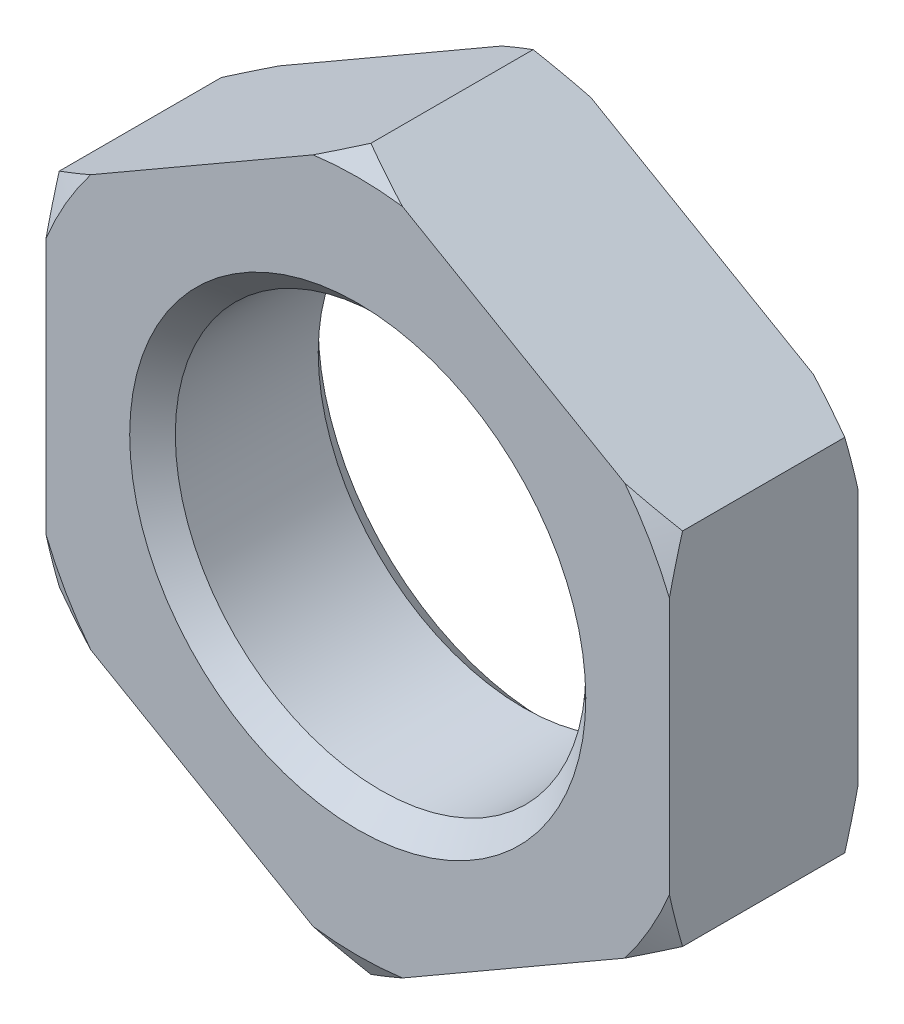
ISO-10303-21;
HEADER;
FILE_DESCRIPTION(('STEP AP214'),'2;1');
FILE_NAME('part.step','',(''),(''),'','','');
FILE_SCHEMA(('AUTOMOTIVE_DESIGN { 1 0 10303 214 1 1 1 1 }'));
ENDSEC;
DATA;
#1=APPLICATION_CONTEXT('core data for automotive mechanical design processes');
#2=APPLICATION_PROTOCOL_DEFINITION('international standard','automotive_design',2000,#1);
#3=PRODUCT_CONTEXT('',#1,'mechanical');
#4=PRODUCT('Part','Part','',(#3));
#5=PRODUCT_RELATED_PRODUCT_CATEGORY('part','',(#4));
#6=PRODUCT_DEFINITION_FORMATION('','',#4);
#7=PRODUCT_DEFINITION_CONTEXT('part definition',#1,'design');
#8=PRODUCT_DEFINITION('design','',#6,#7);
#9=PRODUCT_DEFINITION_SHAPE('','',#8);
#10=(LENGTH_UNIT() NAMED_UNIT(*) SI_UNIT(.MILLI.,.METRE.));
#11=(NAMED_UNIT(*) PLANE_ANGLE_UNIT() SI_UNIT($,.RADIAN.));
#12=(NAMED_UNIT(*) SI_UNIT($,.STERADIAN.) SOLID_ANGLE_UNIT());
#13=UNCERTAINTY_MEASURE_WITH_UNIT(LENGTH_MEASURE(1.E-05),#10,'distance_accuracy_value','');
#14=(GEOMETRIC_REPRESENTATION_CONTEXT(3) GLOBAL_UNCERTAINTY_ASSIGNED_CONTEXT((#13)) GLOBAL_UNIT_ASSIGNED_CONTEXT((#10,
#11,#12)) REPRESENTATION_CONTEXT('',''));
#15=CARTESIAN_POINT('',(0.,0.,0.));
#16=DIRECTION('',(0.,0.,1.));
#17=DIRECTION('',(1.,0.,0.));
#18=AXIS2_PLACEMENT_3D('',#15,#16,#17);
#19=CARTESIAN_POINT('',(0.,0.,-6.2));
#20=DIRECTION('',(0.,0.,1.));
#21=DIRECTION('',(1.,0.,0.));
#22=AXIS2_PLACEMENT_3D('',#19,#20,#21);
#23=PLANE('',#22);
#24=CARTESIAN_POINT('',(0.,0.,-6.2));
#25=DIRECTION('',(0.,0.,1.));
#26=DIRECTION('',(1.,0.,0.));
#27=AXIS2_PLACEMENT_3D('',#24,#25,#26);
#28=CIRCLE('',#27,15.);
#29=CARTESIAN_POINT('',(15.,0.,-6.2));
#30=VERTEX_POINT('',#29);
#31=EDGE_CURVE('E430',#30,#30,#28,.T.);
#32=ORIENTED_EDGE('',*,*,#31,.T.);
#33=EDGE_LOOP('',(#32));
#34=FACE_BOUND('',#33,.T.);
#35=DIRECTION('',(0.,1.,0.));
#36=VECTOR('',#35,1.);
#37=CARTESIAN_POINT('',(20.5,-11.8356805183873,-6.2));
#38=LINE('',#37,#36);
#39=CARTESIAN_POINT('',(20.5,-8.44507254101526,-6.2));
#40=VERTEX_POINT('',#39);
#41=CARTESIAN_POINT('',(20.5,8.44507254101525,-6.2));
#42=VERTEX_POINT('',#41);
#43=EDGE_CURVE('E366',#40,#42,#38,.T.);
#44=ORIENTED_EDGE('',*,*,#43,.F.);
#45=CARTESIAN_POINT('',(0.,0.,-6.2));
#46=DIRECTION('',(0.,0.,-1.));
#47=DIRECTION('',(-1.,0.,0.));
#48=AXIS2_PLACEMENT_3D('',#45,#46,#47);
#49=CIRCLE('',#48,22.1713610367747);
#50=CARTESIAN_POINT('',(17.5636473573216,-13.5309845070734,-6.2));
#51=VERTEX_POINT('',#50);
#52=EDGE_CURVE('E351',#40,#51,#49,.T.);
#53=ORIENTED_EDGE('',*,*,#52,.T.);
#54=DIRECTION('',(0.866025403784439,0.5,0.));
#55=VECTOR('',#54,1.);
#56=CARTESIAN_POINT('',(0.,-23.6713610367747,-6.2));
#57=LINE('',#56,#55);
#58=CARTESIAN_POINT('',(2.9363526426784,-21.9760570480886,-6.2));
#59=VERTEX_POINT('',#58);
#60=EDGE_CURVE('E377',#59,#51,#57,.T.);
#61=ORIENTED_EDGE('',*,*,#60,.F.);
#62=CARTESIAN_POINT('',(-2.93635264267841,-21.9760570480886,-6.2));
#63=VERTEX_POINT('',#62);
#64=EDGE_CURVE('E346',#59,#63,#49,.T.);
#65=ORIENTED_EDGE('',*,*,#64,.T.);
#66=DIRECTION('',(0.866025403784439,-0.5,0.));
#67=VECTOR('',#66,1.);
#68=CARTESIAN_POINT('',(-20.5,-11.8356805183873,-6.2));
#69=LINE('',#68,#67);
#70=CARTESIAN_POINT('',(-17.5636473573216,-13.5309845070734,-6.2));
#71=VERTEX_POINT('',#70);
#72=EDGE_CURVE('E385',#71,#63,#69,.T.);
#73=ORIENTED_EDGE('',*,*,#72,.F.);
#74=CARTESIAN_POINT('',(-20.5,-8.44507254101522,-6.2));
#75=VERTEX_POINT('',#74);
#76=EDGE_CURVE('E338',#71,#75,#49,.T.);
#77=ORIENTED_EDGE('',*,*,#76,.T.);
#78=DIRECTION('',(0.,-1.,0.));
#79=VECTOR('',#78,1.);
#80=CARTESIAN_POINT('',(-20.5,11.8356805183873,-6.2));
#81=LINE('',#80,#79);
#82=CARTESIAN_POINT('',(-20.5,8.44507254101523,-6.2));
#83=VERTEX_POINT('',#82);
#84=EDGE_CURVE('E477',#83,#75,#81,.T.);
#85=ORIENTED_EDGE('',*,*,#84,.F.);
#86=CARTESIAN_POINT('',(-17.5636473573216,13.5309845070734,-6.2));
#87=VERTEX_POINT('',#86);
#88=EDGE_CURVE('E63',#83,#87,#49,.T.);
#89=ORIENTED_EDGE('',*,*,#88,.T.);
#90=DIRECTION('',(-0.866025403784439,-0.5,0.));
#91=VECTOR('',#90,1.);
#92=CARTESIAN_POINT('',(0.,23.6713610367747,-6.2));
#93=LINE('',#92,#91);
#94=CARTESIAN_POINT('',(-2.93635264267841,21.9760570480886,-6.2));
#95=VERTEX_POINT('',#94);
#96=EDGE_CURVE('E181',#95,#87,#93,.T.);
#97=ORIENTED_EDGE('',*,*,#96,.F.);
#98=CARTESIAN_POINT('',(2.93635264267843,21.9760570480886,-6.2));
#99=VERTEX_POINT('',#98);
#100=EDGE_CURVE('E55',#95,#99,#49,.T.);
#101=ORIENTED_EDGE('',*,*,#100,.T.);
#102=DIRECTION('',(-0.866025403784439,0.5,0.));
#103=VECTOR('',#102,1.);
#104=CARTESIAN_POINT('',(20.5,11.8356805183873,-6.2));
#105=LINE('',#104,#103);
#106=CARTESIAN_POINT('',(17.5636473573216,13.5309845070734,-6.2));
#107=VERTEX_POINT('',#106);
#108=EDGE_CURVE('E367',#107,#99,#105,.T.);
#109=ORIENTED_EDGE('',*,*,#108,.F.);
#110=EDGE_CURVE('E343',#107,#42,#49,.T.);
#111=ORIENTED_EDGE('',*,*,#110,.T.);
#112=EDGE_LOOP('',(#44,#53,#61,#65,#73,#77,#85,#89,#97,#101,#109,#111));
#113=FACE_BOUND('',#112,.T.);
#114=ADVANCED_FACE('F39',(#34,#113),#23,.F.);
#115=CARTESIAN_POINT('',(0.,0.,6.2));
#116=DIRECTION('',(0.,0.,1.));
#117=DIRECTION('',(1.,0.,0.));
#118=AXIS2_PLACEMENT_3D('',#115,#116,#117);
#119=PLANE('',#118);
#120=CARTESIAN_POINT('',(0.,0.,6.2));
#121=DIRECTION('',(0.,0.,1.));
#122=DIRECTION('',(1.,0.,0.));
#123=AXIS2_PLACEMENT_3D('',#120,#121,#122);
#124=CIRCLE('',#123,15.);
#125=CARTESIAN_POINT('',(15.,0.,6.2));
#126=VERTEX_POINT('',#125);
#127=EDGE_CURVE('E11',#126,#126,#124,.F.);
#128=ORIENTED_EDGE('',*,*,#127,.T.);
#129=EDGE_LOOP('',(#128));
#130=FACE_BOUND('',#129,.T.);
#131=CARTESIAN_POINT('',(0.,0.,6.2));
#132=DIRECTION('',(0.,0.,-1.));
#133=DIRECTION('',(-1.,0.,0.));
#134=AXIS2_PLACEMENT_3D('',#131,#132,#133);
#135=CIRCLE('',#134,22.1713610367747);
#136=CARTESIAN_POINT('',(20.5,-8.44507254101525,6.2));
#137=VERTEX_POINT('',#136);
#138=CARTESIAN_POINT('',(17.5636473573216,-13.5309845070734,6.2));
#139=VERTEX_POINT('',#138);
#140=EDGE_CURVE('E316',#137,#139,#135,.T.);
#141=ORIENTED_EDGE('',*,*,#140,.F.);
#142=DIRECTION('',(0.,1.,0.));
#143=VECTOR('',#142,1.);
#144=CARTESIAN_POINT('',(20.5,-11.8356805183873,6.2));
#145=LINE('',#144,#143);
#146=CARTESIAN_POINT('',(20.5,8.44507254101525,6.2));
#147=VERTEX_POINT('',#146);
#148=EDGE_CURVE('E392',#137,#147,#145,.T.);
#149=ORIENTED_EDGE('',*,*,#148,.T.);
#150=CARTESIAN_POINT('',(17.5636473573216,13.5309845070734,6.2));
#151=VERTEX_POINT('',#150);
#152=EDGE_CURVE('E307',#151,#147,#135,.T.);
#153=ORIENTED_EDGE('',*,*,#152,.F.);
#154=DIRECTION('',(-0.866025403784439,0.5,0.));
#155=VECTOR('',#154,1.);
#156=CARTESIAN_POINT('',(20.5,11.8356805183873,6.2));
#157=LINE('',#156,#155);
#158=CARTESIAN_POINT('',(2.93635264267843,21.9760570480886,6.2));
#159=VERTEX_POINT('',#158);
#160=EDGE_CURVE('E376',#151,#159,#157,.T.);
#161=ORIENTED_EDGE('',*,*,#160,.T.);
#162=CARTESIAN_POINT('',(-2.93635264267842,21.9760570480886,6.2));
#163=VERTEX_POINT('',#162);
#164=EDGE_CURVE('E297',#163,#159,#135,.T.);
#165=ORIENTED_EDGE('',*,*,#164,.F.);
#166=DIRECTION('',(-0.866025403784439,-0.5,0.));
#167=VECTOR('',#166,1.);
#168=CARTESIAN_POINT('',(0.,23.6713610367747,6.2));
#169=LINE('',#168,#167);
#170=CARTESIAN_POINT('',(-17.5636473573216,13.5309845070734,6.2));
#171=VERTEX_POINT('',#170);
#172=EDGE_CURVE('E383',#163,#171,#169,.T.);
#173=ORIENTED_EDGE('',*,*,#172,.T.);
#174=CARTESIAN_POINT('',(-20.5,8.44507254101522,6.2));
#175=VERTEX_POINT('',#174);
#176=EDGE_CURVE('E295',#175,#171,#135,.T.);
#177=ORIENTED_EDGE('',*,*,#176,.F.);
#178=DIRECTION('',(0.,-1.,0.));
#179=VECTOR('',#178,1.);
#180=CARTESIAN_POINT('',(-20.5,11.8356805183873,6.2));
#181=LINE('',#180,#179);
#182=CARTESIAN_POINT('',(-20.5,-8.44507254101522,6.2));
#183=VERTEX_POINT('',#182);
#184=EDGE_CURVE('E481',#175,#183,#181,.T.);
#185=ORIENTED_EDGE('',*,*,#184,.T.);
#186=CARTESIAN_POINT('',(-17.5636473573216,-13.5309845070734,6.2));
#187=VERTEX_POINT('',#186);
#188=EDGE_CURVE('E298',#187,#183,#135,.T.);
#189=ORIENTED_EDGE('',*,*,#188,.F.);
#190=DIRECTION('',(0.866025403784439,-0.5,0.));
#191=VECTOR('',#190,1.);
#192=CARTESIAN_POINT('',(-20.5,-11.8356805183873,6.2));
#193=LINE('',#192,#191);
#194=CARTESIAN_POINT('',(-2.93635264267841,-21.9760570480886,6.2));
#195=VERTEX_POINT('',#194);
#196=EDGE_CURVE('E468',#187,#195,#193,.T.);
#197=ORIENTED_EDGE('',*,*,#196,.T.);
#198=CARTESIAN_POINT('',(2.93635264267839,-21.9760570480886,6.2));
#199=VERTEX_POINT('',#198);
#200=EDGE_CURVE('E309',#199,#195,#135,.T.);
#201=ORIENTED_EDGE('',*,*,#200,.F.);
#202=DIRECTION('',(0.866025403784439,0.5,0.));
#203=VECTOR('',#202,1.);
#204=CARTESIAN_POINT('',(0.,-23.6713610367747,6.2));
#205=LINE('',#204,#203);
#206=EDGE_CURVE('E466',#199,#139,#205,.T.);
#207=ORIENTED_EDGE('',*,*,#206,.T.);
#208=EDGE_LOOP('',(#141,#149,#153,#161,#165,#173,#177,#185,#189,#197,#201,#207));
#209=FACE_BOUND('',#208,.T.);
#210=ADVANCED_FACE('F421',(#130,#209),#119,.T.);
#211=CARTESIAN_POINT('',(20.5,11.8356805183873,6.2));
#212=DIRECTION('',(-0.5,-0.866025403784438,0.));
#213=DIRECTION('',(0.866025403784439,-0.5,0.));
#214=AXIS2_PLACEMENT_3D('',#211,#212,#213);
#215=PLANE('',#214);
#216=DIRECTION('',(0.,0.,-1.));
#217=VECTOR('',#216,1.);
#218=CARTESIAN_POINT('',(20.5,11.8356805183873,6.2));
#219=LINE('',#218,#217);
#220=CARTESIAN_POINT('',(20.5,11.8356805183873,5.33397459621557));
#221=VERTEX_POINT('',#220);
#222=CARTESIAN_POINT('',(20.5,11.8356805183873,-5.33397459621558));
#223=VERTEX_POINT('',#222);
#224=EDGE_CURVE('E389',#221,#223,#219,.T.);
#225=ORIENTED_EDGE('',*,*,#224,.T.);
#226=CARTESIAN_POINT('',(34.7125186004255,3.63007907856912,1.14992880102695));
#227=CARTESIAN_POINT('',(34.3905456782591,3.81597023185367,0.976211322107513));
#228=CARTESIAN_POINT('',(34.0681820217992,4.00208697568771,0.80346009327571));
#229=CARTESIAN_POINT('',(33.4226047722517,4.37481117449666,0.460079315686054));
#230=CARTESIAN_POINT('',(33.0993911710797,4.56141863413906,0.289449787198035));
#231=CARTESIAN_POINT('',(32.1283062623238,5.12207476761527,-0.219007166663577));
#232=CARTESIAN_POINT('',(31.479066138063,5.49691372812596,-0.553362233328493));
#233=CARTESIAN_POINT('',(30.1742617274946,6.2502429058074,-1.21198728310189));
#234=CARTESIAN_POINT('',(29.5186838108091,6.6287409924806,-1.53622133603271));
#235=CARTESIAN_POINT('',(28.2026104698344,7.38857629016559,-2.17107241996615));
#236=CARTESIAN_POINT('',(27.5421152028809,7.76991341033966,-2.48168988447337));
#237=CARTESIAN_POINT('',(26.1986276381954,8.54557631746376,-3.09397293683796));
#238=CARTESIAN_POINT('',(25.5154891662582,8.93998649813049,-3.39521271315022));
#239=CARTESIAN_POINT('',(24.1423092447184,9.73279229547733,-3.97618456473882));
#240=CARTESIAN_POINT('',(23.4522674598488,10.1311881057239,-4.25591558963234));
#241=CARTESIAN_POINT('',(22.0651563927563,10.9320370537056,-4.78852935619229));
#242=CARTESIAN_POINT('',(21.3680946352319,11.3344858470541,-5.04143806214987));
#243=CARTESIAN_POINT('',(19.9656923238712,12.1441631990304,-5.51457222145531));
#244=CARTESIAN_POINT('',(19.2603528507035,12.5513911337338,-5.73480189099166));
#245=CARTESIAN_POINT('',(18.0621285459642,13.2431862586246,-6.07313354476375));
#246=CARTESIAN_POINT('',(17.5714567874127,13.5264757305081,-6.20168633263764));
#247=CARTESIAN_POINT('',(16.5862664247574,14.0952756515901,-6.43747743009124));
#248=CARTESIAN_POINT('',(16.0917479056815,14.3807860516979,-6.54471620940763));
#249=CARTESIAN_POINT('',(15.099396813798,14.9537202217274,-6.73545005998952));
#250=CARTESIAN_POINT('',(14.6015651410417,15.2411434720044,-6.8189513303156));
#251=CARTESIAN_POINT('',(13.6031394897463,15.8175847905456,-6.96009647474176));
#252=CARTESIAN_POINT('',(13.102545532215,16.106602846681,-7.01774054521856));
#253=CARTESIAN_POINT('',(12.1053433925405,16.6823377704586,-7.10501435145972));
#254=CARTESIAN_POINT('',(11.6087561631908,16.9690425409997,-7.13496069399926));
#255=CARTESIAN_POINT('',(10.614910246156,17.5428397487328,-7.1670857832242));
#256=CARTESIAN_POINT('',(10.1176515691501,17.829932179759,-7.16926496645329));
#257=CARTESIAN_POINT('',(9.12360244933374,18.4038467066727,-7.1457867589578));
#258=CARTESIAN_POINT('',(8.62681203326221,18.6906687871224,-7.12012786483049));
#259=CARTESIAN_POINT('',(7.63483809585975,19.2633852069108,-7.04175114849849));
#260=CARTESIAN_POINT('',(7.13965464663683,19.5492795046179,-6.9890321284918));
#261=CARTESIAN_POINT('',(5.96898623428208,20.2251652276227,-6.83374502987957));
#262=CARTESIAN_POINT('',(5.2946098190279,20.6145166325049,-6.7199483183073));
#263=CARTESIAN_POINT('',(3.95231703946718,21.3894897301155,-6.44961922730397));
#264=CARTESIAN_POINT('',(3.28440177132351,21.7751107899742,-6.29307972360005));
#265=CARTESIAN_POINT('',(1.95520064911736,22.542525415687,-5.94319868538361));
#266=CARTESIAN_POINT('',(1.29392223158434,22.924314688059,-5.74981986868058));
#267=CARTESIAN_POINT('',(-0.0212260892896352,23.6836159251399,-5.33233097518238));
#268=CARTESIAN_POINT('',(-0.675096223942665,24.0611280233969,-5.10822186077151));
#269=CARTESIAN_POINT('',(-1.98338212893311,24.8164672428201,-4.63185774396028));
#270=CARTESIAN_POINT('',(-2.63771653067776,25.1942473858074,-4.37930685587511));
#271=CARTESIAN_POINT('',(-3.93989077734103,25.9460580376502,-3.85288791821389));
#272=CARTESIAN_POINT('',(-4.58773056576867,26.3200885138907,-3.57901968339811));
#273=CARTESIAN_POINT('',(-5.87730368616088,27.0646239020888,-3.01396000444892));
#274=CARTESIAN_POINT('',(-6.51904004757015,27.4351305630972,-2.72277773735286));
#275=CARTESIAN_POINT('',(-7.7974604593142,28.1732269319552,-2.12607094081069));
#276=CARTESIAN_POINT('',(-8.43414461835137,28.5408167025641,-1.82054672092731));
#277=CARTESIAN_POINT('',(-9.50314762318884,29.1580058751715,-1.29580127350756));
#278=CARTESIAN_POINT('',(-9.93663090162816,29.4082775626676,-1.07972948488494));
#279=CARTESIAN_POINT('',(-10.8017230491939,29.9077387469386,-0.642683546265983));
#280=CARTESIAN_POINT('',(-11.2333319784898,30.1569282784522,-0.42170955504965));
#281=CARTESIAN_POINT('',(-12.0903807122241,30.6517455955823,0.0222460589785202));
#282=CARTESIAN_POINT('',(-12.5158379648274,30.8973834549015,0.245182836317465));
#283=CARTESIAN_POINT('',(-13.3652610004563,31.3877980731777,0.694837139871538));
#284=CARTESIAN_POINT('',(-13.7892267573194,31.6325748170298,0.921554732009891));
#285=CARTESIAN_POINT('',(-14.2125186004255,31.8769624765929,1.14992880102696));
#286=B_SPLINE_CURVE_WITH_KNOTS('',3,(#226,#227,#228,#229,#230,#231,#232,#233,#234,#235,#236,
#237,#238,#239,#240,#241,#242,#243,#244,#245,#246,#247,#248,#249,#250,#251,#252,#253,#254,#255,
#256,#257,#258,#259,#260,#261,#262,#263,#264,#265,#266,#267,#268,#269,#270,#271,#272,#273,#274,
#275,#276,#277,#278,#279,#280,#281,#282,#283,#284,#285),.UNSPECIFIED.,.F.,.F.,(4,2,2,2,2,2,2,2,
2,2,2,2,2,2,2,2,2,2,2,2,2,2,2,2,2,2,2,2,2,4),(0.,1.23109391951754,2.46219959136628,
4.92469892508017,7.39512539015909,9.86547314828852,12.3983713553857,14.9313931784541,
17.4619401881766,19.9921604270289,21.7347523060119,23.4773057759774,25.2194037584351,
26.9614885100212,28.6834044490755,30.4052933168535,32.1272751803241,33.8493332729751,
36.2088256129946,38.5687114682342,40.9309983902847,43.2932113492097,45.6827796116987,
48.0723686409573,50.4607022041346,52.8489842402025,54.484524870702,56.120012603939,
57.7384750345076,59.3569657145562),.UNSPECIFIED.);
#287=EDGE_CURVE('E320',#223,#107,#286,.T.);
#288=ORIENTED_EDGE('',*,*,#287,.T.);
#289=ORIENTED_EDGE('',*,*,#108,.T.);
#290=CARTESIAN_POINT('',(0.,23.6713610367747,-5.33397459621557));
#291=VERTEX_POINT('',#290);
#292=EDGE_CURVE('E310',#99,#291,#286,.T.);
#293=ORIENTED_EDGE('',*,*,#292,.T.);
#294=DIRECTION('',(0.,0.,-1.));
#295=VECTOR('',#294,1.);
#296=CARTESIAN_POINT('',(0.,23.6713610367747,6.2));
#297=LINE('',#296,#295);
#298=CARTESIAN_POINT('',(0.,23.6713610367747,5.33397459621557));
#299=VERTEX_POINT('',#298);
#300=EDGE_CURVE('E190',#299,#291,#297,.T.);
#301=ORIENTED_EDGE('',*,*,#300,.F.);
#302=CARTESIAN_POINT('',(-14.2125186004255,31.8769624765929,-1.14992880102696));
#303=CARTESIAN_POINT('',(-13.8905456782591,31.6910713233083,-0.97621132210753));
#304=CARTESIAN_POINT('',(-13.5681820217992,31.5049545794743,-0.803460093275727));
#305=CARTESIAN_POINT('',(-12.9226047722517,31.1322303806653,-0.460079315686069));
#306=CARTESIAN_POINT('',(-12.5993911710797,30.9456229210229,-0.289449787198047));
#307=CARTESIAN_POINT('',(-11.6283062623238,30.3849667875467,0.219007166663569));
#308=CARTESIAN_POINT('',(-10.979066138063,30.010127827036,0.553362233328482));
#309=CARTESIAN_POINT('',(-9.67426172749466,29.2567986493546,1.21198728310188));
#310=CARTESIAN_POINT('',(-9.01868381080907,28.8783005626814,1.5362213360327));
#311=CARTESIAN_POINT('',(-7.70261046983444,28.1184652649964,2.17107241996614));
#312=CARTESIAN_POINT('',(-7.04211520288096,27.7371281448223,2.48168988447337));
#313=CARTESIAN_POINT('',(-5.69862763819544,26.9614652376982,3.09397293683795));
#314=CARTESIAN_POINT('',(-5.01548916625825,26.5670550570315,3.39521271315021));
#315=CARTESIAN_POINT('',(-3.64230924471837,25.7742492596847,3.97618456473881));
#316=CARTESIAN_POINT('',(-2.95226745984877,25.3758534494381,4.25591558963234));
#317=CARTESIAN_POINT('',(-1.5651563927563,24.5750045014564,4.78852935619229));
#318=CARTESIAN_POINT('',(-0.868094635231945,24.1725557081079,5.04143806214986));
#319=CARTESIAN_POINT('',(0.534307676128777,23.3628783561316,5.51457222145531));
#320=CARTESIAN_POINT('',(1.23964714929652,22.9556504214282,5.73480189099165));
#321=CARTESIAN_POINT('',(2.43787145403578,22.2638552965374,6.07313354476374));
#322=CARTESIAN_POINT('',(2.9285432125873,21.9805658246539,6.20168633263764));
#323=CARTESIAN_POINT('',(3.91373357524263,21.4117659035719,6.43747743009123));
#324=CARTESIAN_POINT('',(4.40825209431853,21.1262555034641,6.54471620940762));
#325=CARTESIAN_POINT('',(5.40060318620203,20.5533213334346,6.73545005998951));
#326=CARTESIAN_POINT('',(5.89843485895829,20.2658980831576,6.8189513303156));
#327=CARTESIAN_POINT('',(6.89686051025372,19.6894567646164,6.96009647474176));
#328=CARTESIAN_POINT('',(7.39745446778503,19.400438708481,7.01774054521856));
#329=CARTESIAN_POINT('',(8.39465660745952,18.8247037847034,7.10501435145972));
#330=CARTESIAN_POINT('',(8.89124383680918,18.5379990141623,7.13496069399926));
#331=CARTESIAN_POINT('',(9.88508975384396,17.9642018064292,7.1670857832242));
#332=CARTESIAN_POINT('',(10.3823484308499,17.677109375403,7.16926496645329));
#333=CARTESIAN_POINT('',(11.3763975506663,17.1031948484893,7.1457867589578));
#334=CARTESIAN_POINT('',(11.8731879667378,16.8163727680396,7.12012786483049));
#335=CARTESIAN_POINT('',(12.8651619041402,16.2436563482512,7.04175114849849));
#336=CARTESIAN_POINT('',(13.3603453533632,15.9577620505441,6.9890321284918));
#337=CARTESIAN_POINT('',(14.5310137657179,15.2818763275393,6.83374502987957));
#338=CARTESIAN_POINT('',(15.2053901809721,14.8925249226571,6.71994831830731));
#339=CARTESIAN_POINT('',(16.5476829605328,14.1175518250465,6.44961922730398));
#340=CARTESIAN_POINT('',(17.2155982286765,13.7319307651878,6.29307972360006));
#341=CARTESIAN_POINT('',(18.5447993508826,12.964516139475,5.94319868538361));
#342=CARTESIAN_POINT('',(19.2060777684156,12.582726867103,5.74981986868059));
#343=CARTESIAN_POINT('',(20.5212260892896,11.8234256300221,5.33233097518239));
#344=CARTESIAN_POINT('',(21.1750962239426,11.4459135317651,5.10822186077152));
#345=CARTESIAN_POINT('',(22.4833821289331,10.6905743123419,4.63185774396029));
#346=CARTESIAN_POINT('',(23.1377165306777,10.3127941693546,4.37930685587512));
#347=CARTESIAN_POINT('',(24.439890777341,9.56098351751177,3.85288791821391));
#348=CARTESIAN_POINT('',(25.0877305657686,9.18695304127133,3.57901968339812));
#349=CARTESIAN_POINT('',(26.3773036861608,8.44241765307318,3.01396000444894));
#350=CARTESIAN_POINT('',(27.0190400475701,8.07191099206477,2.72277773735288));
#351=CARTESIAN_POINT('',(28.2974604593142,7.33381462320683,2.12607094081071));
#352=CARTESIAN_POINT('',(28.9341446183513,6.96622485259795,1.82054672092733));
#353=CARTESIAN_POINT('',(30.0031476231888,6.34903567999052,1.29580127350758));
#354=CARTESIAN_POINT('',(30.4366309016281,6.09876399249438,1.07972948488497));
#355=CARTESIAN_POINT('',(31.3017230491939,5.59930280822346,0.642683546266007));
#356=CARTESIAN_POINT('',(31.7333319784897,5.35011327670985,0.421709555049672));
#357=CARTESIAN_POINT('',(32.5903807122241,4.85529595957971,-0.0222460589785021));
#358=CARTESIAN_POINT('',(33.0158379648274,4.60965810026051,-0.24518283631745));
#359=CARTESIAN_POINT('',(33.8652610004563,4.1192434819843,-0.694837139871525));
#360=CARTESIAN_POINT('',(34.2892267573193,3.87446673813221,-0.921554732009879));
#361=CARTESIAN_POINT('',(34.7125186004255,3.63007907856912,-1.14992880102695));
#362=B_SPLINE_CURVE_WITH_KNOTS('',3,(#302,#303,#304,#305,#306,#307,#308,#309,#310,#311,#312,
#313,#314,#315,#316,#317,#318,#319,#320,#321,#322,#323,#324,#325,#326,#327,#328,#329,#330,#331,
#332,#333,#334,#335,#336,#337,#338,#339,#340,#341,#342,#343,#344,#345,#346,#347,#348,#349,#350,
#351,#352,#353,#354,#355,#356,#357,#358,#359,#360,#361),.UNSPECIFIED.,.F.,.F.,(4,2,2,2,2,2,2,2,
2,2,2,2,2,2,2,2,2,2,2,2,2,2,2,2,2,2,2,2,2,4),(0.,1.23109391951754,2.46219959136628,
4.92469892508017,7.39512539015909,9.86547314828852,12.3983713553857,14.9313931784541,
17.4619401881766,19.9921604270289,21.7347523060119,23.4773057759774,25.2194037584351,
26.9614885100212,28.6834044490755,30.4052933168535,32.1272751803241,33.8493332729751,
36.2088256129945,38.5687114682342,40.9309983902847,43.2932113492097,45.6827796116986,
48.0723686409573,50.4607022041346,52.8489842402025,54.484524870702,56.120012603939,
57.7384750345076,59.3569657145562),.UNSPECIFIED.);
#363=EDGE_CURVE('E474',#299,#159,#362,.T.);
#364=ORIENTED_EDGE('',*,*,#363,.T.);
#365=ORIENTED_EDGE('',*,*,#160,.F.);
#366=EDGE_CURVE('E248',#151,#221,#362,.T.);
#367=ORIENTED_EDGE('',*,*,#366,.T.);
#368=EDGE_LOOP('',(#225,#288,#289,#293,#301,#364,#365,#367));
#369=FACE_BOUND('',#368,.T.);
#370=ADVANCED_FACE('F426',(#369),#215,.F.);
#371=CARTESIAN_POINT('',(0.,23.6713610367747,6.2));
#372=DIRECTION('',(0.5,-0.866025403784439,0.));
#373=DIRECTION('',(0.866025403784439,0.5,0.));
#374=AXIS2_PLACEMENT_3D('',#371,#372,#373);
#375=PLANE('',#374);
#376=ORIENTED_EDGE('',*,*,#300,.T.);
#377=CARTESIAN_POINT('',(14.2125186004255,31.8769624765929,1.14992880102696));
#378=CARTESIAN_POINT('',(13.8905456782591,31.6910713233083,0.976211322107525));
#379=CARTESIAN_POINT('',(13.5681820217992,31.5049545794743,0.803460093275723));
#380=CARTESIAN_POINT('',(12.9226047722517,31.1322303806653,0.460079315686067));
#381=CARTESIAN_POINT('',(12.5993911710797,30.9456229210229,0.289449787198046));
#382=CARTESIAN_POINT('',(11.6283062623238,30.3849667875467,-0.219007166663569));
#383=CARTESIAN_POINT('',(10.979066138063,30.010127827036,-0.553362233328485));
#384=CARTESIAN_POINT('',(9.67426172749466,29.2567986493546,-1.21198728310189));
#385=CARTESIAN_POINT('',(9.01868381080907,28.8783005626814,-1.5362213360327));
#386=CARTESIAN_POINT('',(7.70261046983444,28.1184652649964,-2.17107241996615));
#387=CARTESIAN_POINT('',(7.04211520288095,27.7371281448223,-2.48168988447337));
#388=CARTESIAN_POINT('',(5.69862763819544,26.9614652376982,-3.09397293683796));
#389=CARTESIAN_POINT('',(5.01548916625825,26.5670550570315,-3.39521271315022));
#390=CARTESIAN_POINT('',(3.64230924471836,25.7742492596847,-3.97618456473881));
#391=CARTESIAN_POINT('',(2.95226745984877,25.3758534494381,-4.25591558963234));
#392=CARTESIAN_POINT('',(1.56515639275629,24.5750045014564,-4.78852935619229));
#393=CARTESIAN_POINT('',(0.868094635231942,24.1725557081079,-5.04143806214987));
#394=CARTESIAN_POINT('',(-0.534307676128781,23.3628783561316,-5.51457222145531));
#395=CARTESIAN_POINT('',(-1.23964714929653,22.9556504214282,-5.73480189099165));
#396=CARTESIAN_POINT('',(-2.43787145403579,22.2638552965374,-6.07313354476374));
#397=CARTESIAN_POINT('',(-2.9285432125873,21.9805658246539,-6.20168633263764));
#398=CARTESIAN_POINT('',(-3.91373357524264,21.4117659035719,-6.43747743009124));
#399=CARTESIAN_POINT('',(-4.40825209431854,21.1262555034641,-6.54471620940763));
#400=CARTESIAN_POINT('',(-5.40060318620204,20.5533213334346,-6.73545005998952));
#401=CARTESIAN_POINT('',(-5.8984348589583,20.2658980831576,-6.8189513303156));
#402=CARTESIAN_POINT('',(-6.89686051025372,19.6894567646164,-6.96009647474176));
#403=CARTESIAN_POINT('',(-7.39745446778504,19.400438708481,-7.01774054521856));
#404=CARTESIAN_POINT('',(-8.39465660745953,18.8247037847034,-7.10501435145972));
#405=CARTESIAN_POINT('',(-8.89124383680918,18.5379990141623,-7.13496069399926));
#406=CARTESIAN_POINT('',(-9.88508975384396,17.9642018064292,-7.1670857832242));
#407=CARTESIAN_POINT('',(-10.3823484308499,17.677109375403,-7.16926496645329));
#408=CARTESIAN_POINT('',(-11.3763975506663,17.1031948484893,-7.14578675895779));
#409=CARTESIAN_POINT('',(-11.8731879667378,16.8163727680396,-7.12012786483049));
#410=CARTESIAN_POINT('',(-12.8651619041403,16.2436563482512,-7.04175114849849));
#411=CARTESIAN_POINT('',(-13.3603453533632,15.9577620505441,-6.9890321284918));
#412=CARTESIAN_POINT('',(-14.5310137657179,15.2818763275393,-6.83374502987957));
#413=CARTESIAN_POINT('',(-15.2053901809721,14.8925249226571,-6.7199483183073));
#414=CARTESIAN_POINT('',(-16.5476829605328,14.1175518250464,-6.44961922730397));
#415=CARTESIAN_POINT('',(-17.2155982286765,13.7319307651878,-6.29307972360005));
#416=CARTESIAN_POINT('',(-18.5447993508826,12.964516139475,-5.9431986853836));
#417=CARTESIAN_POINT('',(-19.2060777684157,12.582726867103,-5.74981986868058));
#418=CARTESIAN_POINT('',(-20.5212260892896,11.8234256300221,-5.33233097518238));
#419=CARTESIAN_POINT('',(-21.1750962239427,11.4459135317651,-5.10822186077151));
#420=CARTESIAN_POINT('',(-22.4833821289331,10.6905743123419,-4.63185774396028));
#421=CARTESIAN_POINT('',(-23.1377165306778,10.3127941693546,-4.37930685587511));
#422=CARTESIAN_POINT('',(-24.439890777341,9.56098351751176,-3.85288791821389));
#423=CARTESIAN_POINT('',(-25.0877305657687,9.18695304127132,-3.57901968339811));
#424=CARTESIAN_POINT('',(-26.3773036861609,8.44241765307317,-3.01396000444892));
#425=CARTESIAN_POINT('',(-27.0190400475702,8.07191099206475,-2.72277773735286));
#426=CARTESIAN_POINT('',(-28.2974604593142,7.33381462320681,-2.12607094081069));
#427=CARTESIAN_POINT('',(-28.9341446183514,6.96622485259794,-1.8205467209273));
#428=CARTESIAN_POINT('',(-30.0031476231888,6.3490356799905,-1.29580127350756));
#429=CARTESIAN_POINT('',(-30.4366309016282,6.09876399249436,-1.07972948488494));
#430=CARTESIAN_POINT('',(-31.3017230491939,5.59930280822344,-0.642683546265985));
#431=CARTESIAN_POINT('',(-31.7333319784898,5.35011327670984,-0.421709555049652));
#432=CARTESIAN_POINT('',(-32.5903807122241,4.85529595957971,0.0222460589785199));
#433=CARTESIAN_POINT('',(-33.0158379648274,4.60965810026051,0.245182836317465));
#434=CARTESIAN_POINT('',(-33.8652610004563,4.11924348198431,0.694837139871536));
#435=CARTESIAN_POINT('',(-34.2892267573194,3.87446673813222,0.921554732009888));
#436=CARTESIAN_POINT('',(-34.7125186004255,3.63007907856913,1.14992880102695));
#437=B_SPLINE_CURVE_WITH_KNOTS('',3,(#377,#378,#379,#380,#381,#382,#383,#384,#385,#386,#387,
#388,#389,#390,#391,#392,#393,#394,#395,#396,#397,#398,#399,#400,#401,#402,#403,#404,#405,#406,
#407,#408,#409,#410,#411,#412,#413,#414,#415,#416,#417,#418,#419,#420,#421,#422,#423,#424,#425,
#426,#427,#428,#429,#430,#431,#432,#433,#434,#435,#436),.UNSPECIFIED.,.F.,.F.,(4,2,2,2,2,2,2,2,
2,2,2,2,2,2,2,2,2,2,2,2,2,2,2,2,2,2,2,2,2,4),(0.,1.23109391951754,2.46219959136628,
4.92469892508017,7.3951253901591,9.86547314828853,12.3983713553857,14.9313931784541,
17.4619401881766,19.9921604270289,21.7347523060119,23.4773057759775,25.2194037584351,
26.9614885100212,28.6834044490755,30.4052933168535,32.1272751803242,33.8493332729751,
36.2088256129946,38.5687114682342,40.9309983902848,43.2932113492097,45.6827796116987,
48.0723686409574,50.4607022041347,52.8489842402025,54.484524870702,56.120012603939,
57.7384750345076,59.3569657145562),.UNSPECIFIED.);
#438=EDGE_CURVE('E183',#291,#95,#437,.T.);
#439=ORIENTED_EDGE('',*,*,#438,.T.);
#440=ORIENTED_EDGE('',*,*,#96,.T.);
#441=CARTESIAN_POINT('',(-20.5,11.8356805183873,-5.33397459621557));
#442=VERTEX_POINT('',#441);
#443=EDGE_CURVE('E165',#87,#442,#437,.T.);
#444=ORIENTED_EDGE('',*,*,#443,.T.);
#445=DIRECTION('',(0.,0.,-1.));
#446=VECTOR('',#445,1.);
#447=CARTESIAN_POINT('',(-20.5,11.8356805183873,6.2));
#448=LINE('',#447,#446);
#449=CARTESIAN_POINT('',(-20.5,11.8356805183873,5.33397459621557));
#450=VERTEX_POINT('',#449);
#451=EDGE_CURVE('E179',#450,#442,#448,.T.);
#452=ORIENTED_EDGE('',*,*,#451,.F.);
#453=CARTESIAN_POINT('',(-34.7125186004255,3.63007907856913,-1.14992880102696));
#454=CARTESIAN_POINT('',(-34.3905456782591,3.81597023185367,-0.976211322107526));
#455=CARTESIAN_POINT('',(-34.0681820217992,4.00208697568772,-0.803460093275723));
#456=CARTESIAN_POINT('',(-33.4226047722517,4.37481117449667,-0.460079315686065));
#457=CARTESIAN_POINT('',(-33.0993911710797,4.56141863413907,-0.289449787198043));
#458=CARTESIAN_POINT('',(-32.1283062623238,5.12207476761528,0.219007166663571));
#459=CARTESIAN_POINT('',(-31.479066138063,5.49691372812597,0.553362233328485));
#460=CARTESIAN_POINT('',(-30.1742617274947,6.2502429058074,1.21198728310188));
#461=CARTESIAN_POINT('',(-29.5186838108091,6.6287409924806,1.5362213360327));
#462=CARTESIAN_POINT('',(-28.2026104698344,7.38857629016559,2.17107241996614));
#463=CARTESIAN_POINT('',(-27.542115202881,7.76991341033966,2.48168988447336));
#464=CARTESIAN_POINT('',(-26.1986276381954,8.54557631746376,3.09397293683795));
#465=CARTESIAN_POINT('',(-25.5154891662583,8.93998649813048,3.39521271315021));
#466=CARTESIAN_POINT('',(-24.1423092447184,9.73279229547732,3.97618456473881));
#467=CARTESIAN_POINT('',(-23.4522674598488,10.1311881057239,4.25591558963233));
#468=CARTESIAN_POINT('',(-22.0651563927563,10.9320370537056,4.78852935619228));
#469=CARTESIAN_POINT('',(-21.368094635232,11.3344858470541,5.04143806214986));
#470=CARTESIAN_POINT('',(-19.9656923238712,12.1441631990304,5.51457222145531));
#471=CARTESIAN_POINT('',(-19.2603528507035,12.5513911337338,5.73480189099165));
#472=CARTESIAN_POINT('',(-18.0621285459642,13.2431862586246,6.07313354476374));
#473=CARTESIAN_POINT('',(-17.5714567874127,13.5264757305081,6.20168633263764));
#474=CARTESIAN_POINT('',(-16.5862664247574,14.0952756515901,6.43747743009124));
#475=CARTESIAN_POINT('',(-16.0917479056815,14.3807860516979,6.54471620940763));
#476=CARTESIAN_POINT('',(-15.099396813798,14.9537202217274,6.73545005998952));
#477=CARTESIAN_POINT('',(-14.6015651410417,15.2411434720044,6.8189513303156));
#478=CARTESIAN_POINT('',(-13.6031394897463,15.8175847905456,6.96009647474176));
#479=CARTESIAN_POINT('',(-13.102545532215,16.106602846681,7.01774054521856));
#480=CARTESIAN_POINT('',(-12.1053433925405,16.6823377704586,7.10501435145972));
#481=CARTESIAN_POINT('',(-11.6087561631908,16.9690425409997,7.13496069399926));
#482=CARTESIAN_POINT('',(-10.614910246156,17.5428397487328,7.1670857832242));
#483=CARTESIAN_POINT('',(-10.1176515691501,17.829932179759,7.16926496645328));
#484=CARTESIAN_POINT('',(-9.12360244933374,18.4038467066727,7.1457867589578));
#485=CARTESIAN_POINT('',(-8.62681203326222,18.6906687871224,7.12012786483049));
#486=CARTESIAN_POINT('',(-7.63483809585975,19.2633852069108,7.04175114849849));
#487=CARTESIAN_POINT('',(-7.13965464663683,19.5492795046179,6.9890321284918));
#488=CARTESIAN_POINT('',(-5.96898623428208,20.2251652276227,6.83374502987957));
#489=CARTESIAN_POINT('',(-5.29460981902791,20.6145166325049,6.7199483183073));
#490=CARTESIAN_POINT('',(-3.95231703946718,21.3894897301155,6.44961922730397));
#491=CARTESIAN_POINT('',(-3.28440177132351,21.7751107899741,6.29307972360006));
#492=CARTESIAN_POINT('',(-1.95520064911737,22.542525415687,5.94319868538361));
#493=CARTESIAN_POINT('',(-1.29392223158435,22.924314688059,5.74981986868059));
#494=CARTESIAN_POINT('',(0.0212260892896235,23.6836159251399,5.33233097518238));
#495=CARTESIAN_POINT('',(0.675096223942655,24.0611280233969,5.10822186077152));
#496=CARTESIAN_POINT('',(1.9833821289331,24.8164672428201,4.63185774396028));
#497=CARTESIAN_POINT('',(2.63771653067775,25.1942473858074,4.37930685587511));
#498=CARTESIAN_POINT('',(3.93989077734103,25.9460580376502,3.8528879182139));
#499=CARTESIAN_POINT('',(4.58773056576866,26.3200885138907,3.57901968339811));
#500=CARTESIAN_POINT('',(5.87730368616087,27.0646239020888,3.01396000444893));
#501=CARTESIAN_POINT('',(6.51904004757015,27.4351305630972,2.72277773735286));
#502=CARTESIAN_POINT('',(7.79746045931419,28.1732269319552,2.1260709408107));
#503=CARTESIAN_POINT('',(8.43414461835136,28.5408167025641,1.82054672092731));
#504=CARTESIAN_POINT('',(9.50314762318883,29.1580058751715,1.29580127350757));
#505=CARTESIAN_POINT('',(9.93663090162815,29.4082775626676,1.07972948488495));
#506=CARTESIAN_POINT('',(10.8017230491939,29.9077387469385,0.642683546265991));
#507=CARTESIAN_POINT('',(11.2333319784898,30.1569282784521,0.421709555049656));
#508=CARTESIAN_POINT('',(12.0903807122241,30.6517455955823,-0.0222460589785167));
#509=CARTESIAN_POINT('',(12.5158379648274,30.8973834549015,-0.245182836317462));
#510=CARTESIAN_POINT('',(13.3652610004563,31.3877980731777,-0.694837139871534));
#511=CARTESIAN_POINT('',(13.7892267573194,31.6325748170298,-0.921554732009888));
#512=CARTESIAN_POINT('',(14.2125186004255,31.8769624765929,-1.14992880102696));
#513=B_SPLINE_CURVE_WITH_KNOTS('',3,(#453,#454,#455,#456,#457,#458,#459,#460,#461,#462,#463,
#464,#465,#466,#467,#468,#469,#470,#471,#472,#473,#474,#475,#476,#477,#478,#479,#480,#481,#482,
#483,#484,#485,#486,#487,#488,#489,#490,#491,#492,#493,#494,#495,#496,#497,#498,#499,#500,#501,
#502,#503,#504,#505,#506,#507,#508,#509,#510,#511,#512),.UNSPECIFIED.,.F.,.F.,(4,2,2,2,2,2,2,2,
2,2,2,2,2,2,2,2,2,2,2,2,2,2,2,2,2,2,2,2,2,4),(0.,1.23109391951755,2.46219959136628,
4.92469892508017,7.39512539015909,9.86547314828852,12.3983713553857,14.9313931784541,
17.4619401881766,19.9921604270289,21.7347523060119,23.4773057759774,25.2194037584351,
26.9614885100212,28.6834044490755,30.4052933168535,32.1272751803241,33.8493332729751,
36.2088256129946,38.5687114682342,40.9309983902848,43.2932113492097,45.6827796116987,
48.0723686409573,50.4607022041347,52.8489842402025,54.484524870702,56.120012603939,
57.7384750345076,59.3569657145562),.UNSPECIFIED.);
#514=EDGE_CURVE('E268',#450,#171,#513,.T.);
#515=ORIENTED_EDGE('',*,*,#514,.T.);
#516=ORIENTED_EDGE('',*,*,#172,.F.);
#517=EDGE_CURVE('E485',#163,#299,#513,.T.);
#518=ORIENTED_EDGE('',*,*,#517,.T.);
#519=EDGE_LOOP('',(#376,#439,#440,#444,#452,#515,#516,#518));
#520=FACE_BOUND('',#519,.T.);
#521=ADVANCED_FACE('F177',(#520),#375,.F.);
#522=CARTESIAN_POINT('',(-20.5,11.8356805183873,6.2));
#523=DIRECTION('',(1.,0.,0.));
#524=DIRECTION('',(0.,0.,-1.));
#525=AXIS2_PLACEMENT_3D('',#522,#523,#524);
#526=PLANE('',#525);
#527=ORIENTED_EDGE('',*,*,#451,.T.);
#528=CARTESIAN_POINT('',(-20.5,26.0481991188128,0.137093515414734));
#529=CARTESIAN_POINT('',(-20.5,25.677953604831,-0.0308823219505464));
#530=CARTESIAN_POINT('',(-20.5,25.3071958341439,-0.197728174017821));
#531=CARTESIAN_POINT('',(-20.5,24.5645647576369,-0.52893159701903));
#532=CARTESIAN_POINT('',(-20.5,24.1926914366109,-0.693289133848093));
#533=CARTESIAN_POINT('',(-20.5,23.0751513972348,-1.1823348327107));
#534=CARTESIAN_POINT('',(-20.5,22.3276892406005,-1.5029393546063));
#535=CARTESIAN_POINT('',(-20.5,20.8240957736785,-2.13229139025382));
#536=CARTESIAN_POINT('',(-20.5,20.0679412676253,-2.44098362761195));
#537=CARTESIAN_POINT('',(-20.5,18.5492339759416,-3.04216947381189));
#538=CARTESIAN_POINT('',(-20.5,17.7866814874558,-3.33466383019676));
#539=CARTESIAN_POINT('',(-20.5,16.2577127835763,-3.89855747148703));
#540=CARTESIAN_POINT('',(-20.5,15.4913298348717,-4.17004651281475));
#541=CARTESIAN_POINT('',(-20.5,13.9503676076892,-4.688978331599));
#542=CARTESIAN_POINT('',(-20.5,13.1757879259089,-4.93641991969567));
#543=CARTESIAN_POINT('',(-20.5,11.6188056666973,-5.40157845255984));
#544=CARTESIAN_POINT('',(-20.5,10.8364148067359,-5.61933432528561));
#545=CARTESIAN_POINT('',(-20.5,9.26258331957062,-6.0192869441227));
#546=CARTESIAN_POINT('',(-20.5,8.47114397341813,-6.20148865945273));
#547=CARTESIAN_POINT('',(-20.5,7.10464805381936,-6.47812396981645));
#548=CARTESIAN_POINT('',(-20.5,6.53166576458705,-6.58280854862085));
#549=CARTESIAN_POINT('',(-20.5,5.38179316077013,-6.76804799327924));
#550=CARTESIAN_POINT('',(-20.5,4.80490296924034,-6.84860361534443));
#551=CARTESIAN_POINT('',(-20.5,3.64818420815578,-6.98345135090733));
#552=CARTESIAN_POINT('',(-20.5,3.06835641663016,-7.03775008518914));
#553=CARTESIAN_POINT('',(-20.5,1.90674909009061,-7.11853523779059));
#554=CARTESIAN_POINT('',(-20.5,1.32496955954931,-7.14502171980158));
#555=CARTESIAN_POINT('',(-20.5,0.161095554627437,-7.16935591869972));
#556=CARTESIAN_POINT('',(-20.5,-0.420998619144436,-7.16721787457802));
#557=CARTESIAN_POINT('',(-20.5,-1.58437079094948,-7.13440567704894));
#558=CARTESIAN_POINT('',(-20.5,-2.16564879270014,-7.10373165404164));
#559=CARTESIAN_POINT('',(-20.5,-3.32613555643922,-7.01478375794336));
#560=CARTESIAN_POINT('',(-20.5,-3.90534408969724,-6.95650692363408));
#561=CARTESIAN_POINT('',(-20.5,-5.06054750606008,-6.81402921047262));
#562=CARTESIAN_POINT('',(-20.5,-5.63654225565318,-6.72982726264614));
#563=CARTESIAN_POINT('',(-20.5,-7.06929930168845,-6.48998139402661));
#564=CARTESIAN_POINT('',(-20.5,-7.92360856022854,-6.31961768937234));
#565=CARTESIAN_POINT('',(-20.5,-9.6219984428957,-5.9338602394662));
#566=CARTESIAN_POINT('',(-20.5,-10.4660767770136,-5.71845660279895));
#567=CARTESIAN_POINT('',(-20.5,-12.1456660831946,-5.25018570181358));
#568=CARTESIAN_POINT('',(-20.5,-12.9811542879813,-4.99723755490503));
#569=CARTESIAN_POINT('',(-20.5,-14.6423073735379,-4.46135393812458));
#570=CARTESIAN_POINT('',(-20.5,-15.4679729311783,-4.17842054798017));
#571=CARTESIAN_POINT('',(-20.5,-17.1198695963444,-3.58509625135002));
#572=CARTESIAN_POINT('',(-20.5,-17.9460016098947,-3.27443113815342));
#573=CARTESIAN_POINT('',(-20.5,-19.5905552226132,-2.63327415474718));
#574=CARTESIAN_POINT('',(-20.5,-20.4089763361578,-2.30278104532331));
#575=CARTESIAN_POINT('',(-20.5,-22.0341394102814,-1.62789801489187));
#576=CARTESIAN_POINT('',(-20.5,-22.8409222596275,-1.28360624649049));
#577=CARTESIAN_POINT('',(-20.5,-24.046778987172,-0.757574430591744));
#578=CARTESIAN_POINT('',(-20.5,-24.4479658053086,-0.580652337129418));
#579=CARTESIAN_POINT('',(-20.5,-25.2490331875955,-0.223893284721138));
#580=CARTESIAN_POINT('',(-20.5,-25.6489137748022,-0.0440563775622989));
#581=CARTESIAN_POINT('',(-20.5,-26.0481991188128,0.13709351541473));
#582=B_SPLINE_CURVE_WITH_KNOTS('',3,(#528,#529,#530,#531,#532,#533,#534,#535,#536,#537,#538,
#539,#540,#541,#542,#543,#544,#545,#546,#547,#548,#549,#550,#551,#552,#553,#554,#555,#556,#557,
#558,#559,#560,#561,#562,#563,#564,#565,#566,#567,#568,#569,#570,#571,#572,#573,#574,#575,#576,
#577,#578,#579,#580,#581),.UNSPECIFIED.,.F.,.F.,(4,2,2,2,2,2,2,2,2,2,2,2,2,2,2,2,2,2,2,2,2,2,2,
2,2,2,4),(0.,1.21970076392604,2.4394182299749,4.87926394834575,7.32932707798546,9.7792770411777,
12.2181024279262,14.6570483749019,17.0927646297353,19.5281402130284,21.27509389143,
23.0219928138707,24.7684510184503,26.5149052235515,28.2604907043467,30.0060682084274,
31.7518330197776,33.4976698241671,36.1095006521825,38.7219056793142,41.3400225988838,
43.957958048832,46.6054841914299,49.2531759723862,51.8845568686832,53.1999451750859,
54.5153101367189),.UNSPECIFIED.);
#583=EDGE_CURVE('E162',#442,#83,#582,.T.);
#584=ORIENTED_EDGE('',*,*,#583,.T.);
#585=ORIENTED_EDGE('',*,*,#84,.T.);
#586=CARTESIAN_POINT('',(-20.5,-11.8356805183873,-5.33397459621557));
#587=VERTEX_POINT('',#586);
#588=EDGE_CURVE('E171',#75,#587,#582,.T.);
#589=ORIENTED_EDGE('',*,*,#588,.T.);
#590=DIRECTION('',(0.,0.,-1.));
#591=VECTOR('',#590,1.);
#592=CARTESIAN_POINT('',(-20.5,-11.8356805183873,6.2));
#593=LINE('',#592,#591);
#594=CARTESIAN_POINT('',(-20.5,-11.8356805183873,5.33397459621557));
#595=VERTEX_POINT('',#594);
#596=EDGE_CURVE('E191',#595,#587,#593,.T.);
#597=ORIENTED_EDGE('',*,*,#596,.F.);
#598=CARTESIAN_POINT('',(-20.5,-26.0481991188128,-0.137093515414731));
#599=CARTESIAN_POINT('',(-20.5,-25.677953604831,0.0308823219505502));
#600=CARTESIAN_POINT('',(-20.5,-25.3071958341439,0.197728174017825));
#601=CARTESIAN_POINT('',(-20.5,-24.5645647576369,0.528931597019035));
#602=CARTESIAN_POINT('',(-20.5,-24.1926914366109,0.693289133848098));
#603=CARTESIAN_POINT('',(-20.5,-23.0751513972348,1.1823348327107));
#604=CARTESIAN_POINT('',(-20.5,-22.3276892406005,1.50293935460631));
#605=CARTESIAN_POINT('',(-20.5,-20.8240957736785,2.13229139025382));
#606=CARTESIAN_POINT('',(-20.5,-20.0679412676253,2.44098362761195));
#607=CARTESIAN_POINT('',(-20.5,-18.5492339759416,3.04216947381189));
#608=CARTESIAN_POINT('',(-20.5,-17.7866814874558,3.33466383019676));
#609=CARTESIAN_POINT('',(-20.5,-16.2577127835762,3.89855747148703));
#610=CARTESIAN_POINT('',(-20.5,-15.4913298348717,4.17004651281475));
#611=CARTESIAN_POINT('',(-20.5,-13.9503676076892,4.688978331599));
#612=CARTESIAN_POINT('',(-20.5,-13.1757879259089,4.93641991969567));
#613=CARTESIAN_POINT('',(-20.5,-11.6188056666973,5.40157845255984));
#614=CARTESIAN_POINT('',(-20.5,-10.8364148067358,5.61933432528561));
#615=CARTESIAN_POINT('',(-20.5,-9.26258331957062,6.0192869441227));
#616=CARTESIAN_POINT('',(-20.5,-8.47114397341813,6.20148865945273));
#617=CARTESIAN_POINT('',(-20.5,-7.10464805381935,6.47812396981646));
#618=CARTESIAN_POINT('',(-20.5,-6.53166576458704,6.58280854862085));
#619=CARTESIAN_POINT('',(-20.5,-5.38179316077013,6.76804799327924));
#620=CARTESIAN_POINT('',(-20.5,-4.80490296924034,6.84860361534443));
#621=CARTESIAN_POINT('',(-20.5,-3.64818420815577,6.98345135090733));
#622=CARTESIAN_POINT('',(-20.5,-3.06835641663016,7.03775008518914));
#623=CARTESIAN_POINT('',(-20.5,-1.90674909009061,7.11853523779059));
#624=CARTESIAN_POINT('',(-20.5,-1.3249695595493,7.14502171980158));
#625=CARTESIAN_POINT('',(-20.5,-0.161095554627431,7.16935591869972));
#626=CARTESIAN_POINT('',(-20.5,0.420998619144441,7.16721787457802));
#627=CARTESIAN_POINT('',(-20.5,1.58437079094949,7.13440567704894));
#628=CARTESIAN_POINT('',(-20.5,2.16564879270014,7.10373165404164));
#629=CARTESIAN_POINT('',(-20.5,3.32613555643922,7.01478375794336));
#630=CARTESIAN_POINT('',(-20.5,3.90534408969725,6.95650692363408));
#631=CARTESIAN_POINT('',(-20.5,5.06054750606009,6.81402921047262));
#632=CARTESIAN_POINT('',(-20.5,5.63654225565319,6.72982726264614));
#633=CARTESIAN_POINT('',(-20.5,7.06929930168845,6.48998139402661));
#634=CARTESIAN_POINT('',(-20.5,7.92360856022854,6.31961768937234));
#635=CARTESIAN_POINT('',(-20.5,9.6219984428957,5.9338602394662));
#636=CARTESIAN_POINT('',(-20.5,10.4660767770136,5.71845660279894));
#637=CARTESIAN_POINT('',(-20.5,12.1456660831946,5.25018570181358));
#638=CARTESIAN_POINT('',(-20.5,12.9811542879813,4.99723755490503));
#639=CARTESIAN_POINT('',(-20.5,14.6423073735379,4.46135393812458));
#640=CARTESIAN_POINT('',(-20.5,15.4679729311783,4.17842054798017));
#641=CARTESIAN_POINT('',(-20.5,17.1198695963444,3.58509625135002));
#642=CARTESIAN_POINT('',(-20.5,17.9460016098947,3.27443113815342));
#643=CARTESIAN_POINT('',(-20.5,19.5905552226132,2.63327415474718));
#644=CARTESIAN_POINT('',(-20.5,20.4089763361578,2.30278104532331));
#645=CARTESIAN_POINT('',(-20.5,22.0341394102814,1.62789801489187));
#646=CARTESIAN_POINT('',(-20.5,22.8409222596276,1.28360624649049));
#647=CARTESIAN_POINT('',(-20.5,24.046778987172,0.75757443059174));
#648=CARTESIAN_POINT('',(-20.5,24.4479658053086,0.580652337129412));
#649=CARTESIAN_POINT('',(-20.5,25.2490331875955,0.223893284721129));
#650=CARTESIAN_POINT('',(-20.5,25.6489137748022,0.0440563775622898));
#651=CARTESIAN_POINT('',(-20.5,26.0481991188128,-0.137093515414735));
#652=B_SPLINE_CURVE_WITH_KNOTS('',3,(#598,#599,#600,#601,#602,#603,#604,#605,#606,#607,#608,
#609,#610,#611,#612,#613,#614,#615,#616,#617,#618,#619,#620,#621,#622,#623,#624,#625,#626,#627,
#628,#629,#630,#631,#632,#633,#634,#635,#636,#637,#638,#639,#640,#641,#642,#643,#644,#645,#646,
#647,#648,#649,#650,#651),.UNSPECIFIED.,.F.,.F.,(4,2,2,2,2,2,2,2,2,2,2,2,2,2,2,2,2,2,2,2,2,2,2,
2,2,2,4),(0.,1.21970076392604,2.4394182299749,4.87926394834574,7.32932707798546,9.7792770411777,
12.2181024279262,14.6570483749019,17.0927646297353,19.5281402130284,21.27509389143,
23.0219928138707,24.7684510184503,26.5149052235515,28.2604907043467,30.0060682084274,
31.7518330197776,33.4976698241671,36.1095006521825,38.7219056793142,41.3400225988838,
43.957958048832,46.6054841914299,49.2531759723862,51.8845568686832,53.1999451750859,
54.5153101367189),.UNSPECIFIED.);
#653=EDGE_CURVE('E260',#595,#183,#652,.T.);
#654=ORIENTED_EDGE('',*,*,#653,.T.);
#655=ORIENTED_EDGE('',*,*,#184,.F.);
#656=EDGE_CURVE('E188',#175,#450,#652,.T.);
#657=ORIENTED_EDGE('',*,*,#656,.T.);
#658=EDGE_LOOP('',(#527,#584,#585,#589,#597,#654,#655,#657));
#659=FACE_BOUND('',#658,.T.);
#660=ADVANCED_FACE('F186',(#659),#526,.F.);
#661=CARTESIAN_POINT('',(-20.5,-11.8356805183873,6.2));
#662=DIRECTION('',(0.5,0.866025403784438,0.));
#663=DIRECTION('',(-0.866025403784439,0.5,0.));
#664=AXIS2_PLACEMENT_3D('',#661,#662,#663);
#665=PLANE('',#664);
#666=ORIENTED_EDGE('',*,*,#596,.T.);
#667=CARTESIAN_POINT('',(-34.7125186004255,-3.63007907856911,1.14992880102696));
#668=CARTESIAN_POINT('',(-34.3905456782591,-3.81597023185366,0.976211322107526));
#669=CARTESIAN_POINT('',(-34.0681820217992,-4.0020869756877,0.803460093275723));
#670=CARTESIAN_POINT('',(-33.4226047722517,-4.37481117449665,0.460079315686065));
#671=CARTESIAN_POINT('',(-33.0993911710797,-4.56141863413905,0.289449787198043));
#672=CARTESIAN_POINT('',(-32.1283062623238,-5.12207476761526,-0.219007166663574));
#673=CARTESIAN_POINT('',(-31.479066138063,-5.49691372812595,-0.553362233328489));
#674=CARTESIAN_POINT('',(-30.1742617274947,-6.25024290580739,-1.21198728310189));
#675=CARTESIAN_POINT('',(-29.5186838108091,-6.62874099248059,-1.5362213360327));
#676=CARTESIAN_POINT('',(-28.2026104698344,-7.38857629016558,-2.17107241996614));
#677=CARTESIAN_POINT('',(-27.542115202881,-7.76991341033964,-2.48168988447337));
#678=CARTESIAN_POINT('',(-26.1986276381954,-8.54557631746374,-3.09397293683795));
#679=CARTESIAN_POINT('',(-25.5154891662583,-8.93998649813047,-3.39521271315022));
#680=CARTESIAN_POINT('',(-24.1423092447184,-9.73279229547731,-3.97618456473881));
#681=CARTESIAN_POINT('',(-23.4522674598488,-10.1311881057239,-4.25591558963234));
#682=CARTESIAN_POINT('',(-22.0651563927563,-10.9320370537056,-4.78852935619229));
#683=CARTESIAN_POINT('',(-21.368094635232,-11.3344858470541,-5.04143806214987));
#684=CARTESIAN_POINT('',(-19.9656923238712,-12.1441631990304,-5.51457222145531));
#685=CARTESIAN_POINT('',(-19.2603528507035,-12.5513911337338,-5.73480189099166));
#686=CARTESIAN_POINT('',(-18.0621285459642,-13.2431862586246,-6.07313354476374));
#687=CARTESIAN_POINT('',(-17.5714567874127,-13.5264757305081,-6.20168633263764));
#688=CARTESIAN_POINT('',(-16.5862664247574,-14.0952756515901,-6.43747743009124));
#689=CARTESIAN_POINT('',(-16.0917479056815,-14.3807860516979,-6.54471620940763));
#690=CARTESIAN_POINT('',(-15.099396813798,-14.9537202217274,-6.73545005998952));
#691=CARTESIAN_POINT('',(-14.6015651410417,-15.2411434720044,-6.8189513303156));
#692=CARTESIAN_POINT('',(-13.6031394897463,-15.8175847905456,-6.96009647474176));
#693=CARTESIAN_POINT('',(-13.102545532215,-16.106602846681,-7.01774054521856));
#694=CARTESIAN_POINT('',(-12.1053433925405,-16.6823377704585,-7.10501435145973));
#695=CARTESIAN_POINT('',(-11.6087561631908,-16.9690425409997,-7.13496069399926));
#696=CARTESIAN_POINT('',(-10.6149102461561,-17.5428397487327,-7.1670857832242));
#697=CARTESIAN_POINT('',(-10.1176515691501,-17.829932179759,-7.16926496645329));
#698=CARTESIAN_POINT('',(-9.12360244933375,-18.4038467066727,-7.1457867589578));
#699=CARTESIAN_POINT('',(-8.62681203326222,-18.6906687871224,-7.12012786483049));
#700=CARTESIAN_POINT('',(-7.63483809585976,-19.2633852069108,-7.0417511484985));
#701=CARTESIAN_POINT('',(-7.13965464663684,-19.5492795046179,-6.98903212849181));
#702=CARTESIAN_POINT('',(-5.9689862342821,-20.2251652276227,-6.83374502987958));
#703=CARTESIAN_POINT('',(-5.29460981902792,-20.6145166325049,-6.71994831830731));
#704=CARTESIAN_POINT('',(-3.95231703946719,-21.3894897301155,-6.44961922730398));
#705=CARTESIAN_POINT('',(-3.28440177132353,-21.7751107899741,-6.29307972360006));
#706=CARTESIAN_POINT('',(-1.95520064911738,-22.542525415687,-5.94319868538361));
#707=CARTESIAN_POINT('',(-1.29392223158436,-22.924314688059,-5.74981986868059));
#708=CARTESIAN_POINT('',(0.0212260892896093,-23.6836159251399,-5.33233097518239));
#709=CARTESIAN_POINT('',(0.675096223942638,-24.0611280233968,-5.10822186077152));
#710=CARTESIAN_POINT('',(1.98338212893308,-24.8164672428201,-4.63185774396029));
#711=CARTESIAN_POINT('',(2.63771653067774,-25.1942473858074,-4.37930685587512));
#712=CARTESIAN_POINT('',(3.93989077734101,-25.9460580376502,-3.85288791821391));
#713=CARTESIAN_POINT('',(4.58773056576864,-26.3200885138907,-3.57901968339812));
#714=CARTESIAN_POINT('',(5.87730368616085,-27.0646239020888,-3.01396000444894));
#715=CARTESIAN_POINT('',(6.51904004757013,-27.4351305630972,-2.72277773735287));
#716=CARTESIAN_POINT('',(7.79746045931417,-28.1732269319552,-2.12607094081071));
#717=CARTESIAN_POINT('',(8.43414461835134,-28.540816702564,-1.82054672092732));
#718=CARTESIAN_POINT('',(9.50314762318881,-29.1580058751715,-1.29580127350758));
#719=CARTESIAN_POINT('',(9.93663090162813,-29.4082775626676,-1.07972948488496));
#720=CARTESIAN_POINT('',(10.8017230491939,-29.9077387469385,-0.642683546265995));
#721=CARTESIAN_POINT('',(11.2333319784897,-30.1569282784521,-0.421709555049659));
#722=CARTESIAN_POINT('',(12.0903807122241,-30.6517455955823,0.022246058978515));
#723=CARTESIAN_POINT('',(12.5158379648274,-30.8973834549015,0.245182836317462));
#724=CARTESIAN_POINT('',(13.3652610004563,-31.3877980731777,0.694837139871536));
#725=CARTESIAN_POINT('',(13.7892267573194,-31.6325748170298,0.921554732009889));
#726=CARTESIAN_POINT('',(14.2125186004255,-31.8769624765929,1.14992880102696));
#727=B_SPLINE_CURVE_WITH_KNOTS('',3,(#667,#668,#669,#670,#671,#672,#673,#674,#675,#676,#677,
#678,#679,#680,#681,#682,#683,#684,#685,#686,#687,#688,#689,#690,#691,#692,#693,#694,#695,#696,
#697,#698,#699,#700,#701,#702,#703,#704,#705,#706,#707,#708,#709,#710,#711,#712,#713,#714,#715,
#716,#717,#718,#719,#720,#721,#722,#723,#724,#725,#726),.UNSPECIFIED.,.F.,.F.,(4,2,2,2,2,2,2,2,
2,2,2,2,2,2,2,2,2,2,2,2,2,2,2,2,2,2,2,2,2,4),(0.,1.23109391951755,2.46219959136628,
4.92469892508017,7.39512539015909,9.86547314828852,12.3983713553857,14.9313931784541,
17.4619401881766,19.9921604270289,21.7347523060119,23.4773057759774,25.2194037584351,
26.9614885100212,28.6834044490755,30.4052933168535,32.1272751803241,33.8493332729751,
36.2088256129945,38.5687114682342,40.9309983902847,43.2932113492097,45.6827796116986,
48.0723686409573,50.4607022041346,52.8489842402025,54.484524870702,56.120012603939,
57.7384750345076,59.3569657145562),.UNSPECIFIED.);
#728=EDGE_CURVE('E286',#587,#71,#727,.T.);
#729=ORIENTED_EDGE('',*,*,#728,.T.);
#730=ORIENTED_EDGE('',*,*,#72,.T.);
#731=CARTESIAN_POINT('',(0.,-23.6713610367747,-5.33397459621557));
#732=VERTEX_POINT('',#731);
#733=EDGE_CURVE('E287',#63,#732,#727,.T.);
#734=ORIENTED_EDGE('',*,*,#733,.T.);
#735=DIRECTION('',(0.,0.,-1.));
#736=VECTOR('',#735,1.);
#737=CARTESIAN_POINT('',(0.,-23.6713610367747,6.2));
#738=LINE('',#737,#736);
#739=CARTESIAN_POINT('',(0.,-23.6713610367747,5.33397459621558));
#740=VERTEX_POINT('',#739);
#741=EDGE_CURVE('E200',#740,#732,#738,.T.);
#742=ORIENTED_EDGE('',*,*,#741,.F.);
#743=CARTESIAN_POINT('',(14.2125186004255,-31.8769624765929,-1.14992880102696));
#744=CARTESIAN_POINT('',(13.8905456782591,-31.6910713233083,-0.976211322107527));
#745=CARTESIAN_POINT('',(13.5681820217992,-31.5049545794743,-0.803460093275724));
#746=CARTESIAN_POINT('',(12.9226047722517,-31.1322303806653,-0.460079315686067));
#747=CARTESIAN_POINT('',(12.5993911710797,-30.9456229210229,-0.289449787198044));
#748=CARTESIAN_POINT('',(11.6283062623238,-30.3849667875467,0.219007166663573));
#749=CARTESIAN_POINT('',(10.979066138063,-30.010127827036,0.553362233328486));
#750=CARTESIAN_POINT('',(9.67426172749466,-29.2567986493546,1.21198728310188));
#751=CARTESIAN_POINT('',(9.01868381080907,-28.8783005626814,1.5362213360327));
#752=CARTESIAN_POINT('',(7.70261046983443,-28.1184652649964,2.17107241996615));
#753=CARTESIAN_POINT('',(7.04211520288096,-27.7371281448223,2.48168988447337));
#754=CARTESIAN_POINT('',(5.69862763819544,-26.9614652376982,3.09397293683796));
#755=CARTESIAN_POINT('',(5.01548916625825,-26.5670550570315,3.39521271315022));
#756=CARTESIAN_POINT('',(3.64230924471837,-25.7742492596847,3.97618456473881));
#757=CARTESIAN_POINT('',(2.95226745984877,-25.3758534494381,4.25591558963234));
#758=CARTESIAN_POINT('',(1.5651563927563,-24.5750045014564,4.78852935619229));
#759=CARTESIAN_POINT('',(0.868094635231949,-24.1725557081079,5.04143806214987));
#760=CARTESIAN_POINT('',(-0.534307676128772,-23.3628783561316,5.51457222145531));
#761=CARTESIAN_POINT('',(-1.23964714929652,-22.9556504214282,5.73480189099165));
#762=CARTESIAN_POINT('',(-2.43787145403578,-22.2638552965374,6.07313354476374));
#763=CARTESIAN_POINT('',(-2.92854321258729,-21.9805658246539,6.20168633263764));
#764=CARTESIAN_POINT('',(-3.91373357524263,-21.4117659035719,6.43747743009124));
#765=CARTESIAN_POINT('',(-4.40825209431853,-21.1262555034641,6.54471620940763));
#766=CARTESIAN_POINT('',(-5.40060318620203,-20.5533213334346,6.73545005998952));
#767=CARTESIAN_POINT('',(-5.89843485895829,-20.2658980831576,6.8189513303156));
#768=CARTESIAN_POINT('',(-6.89686051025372,-19.6894567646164,6.96009647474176));
#769=CARTESIAN_POINT('',(-7.39745446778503,-19.400438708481,7.01774054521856));
#770=CARTESIAN_POINT('',(-8.39465660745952,-18.8247037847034,7.10501435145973));
#771=CARTESIAN_POINT('',(-8.89124383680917,-18.5379990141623,7.13496069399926));
#772=CARTESIAN_POINT('',(-9.88508975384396,-17.9642018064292,7.1670857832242));
#773=CARTESIAN_POINT('',(-10.3823484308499,-17.677109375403,7.16926496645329));
#774=CARTESIAN_POINT('',(-11.3763975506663,-17.1031948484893,7.1457867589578));
#775=CARTESIAN_POINT('',(-11.8731879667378,-16.8163727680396,7.1201278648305));
#776=CARTESIAN_POINT('',(-12.8651619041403,-16.2436563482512,7.0417511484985));
#777=CARTESIAN_POINT('',(-13.3603453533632,-15.9577620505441,6.9890321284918));
#778=CARTESIAN_POINT('',(-14.5310137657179,-15.2818763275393,6.83374502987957));
#779=CARTESIAN_POINT('',(-15.2053901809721,-14.8925249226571,6.71994831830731));
#780=CARTESIAN_POINT('',(-16.5476829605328,-14.1175518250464,6.44961922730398));
#781=CARTESIAN_POINT('',(-17.2155982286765,-13.7319307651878,6.29307972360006));
#782=CARTESIAN_POINT('',(-18.5447993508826,-12.964516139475,5.94319868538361));
#783=CARTESIAN_POINT('',(-19.2060777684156,-12.582726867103,5.74981986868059));
#784=CARTESIAN_POINT('',(-20.5212260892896,-11.8234256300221,5.33233097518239));
#785=CARTESIAN_POINT('',(-21.1750962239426,-11.4459135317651,5.10822186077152));
#786=CARTESIAN_POINT('',(-22.4833821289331,-10.6905743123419,4.63185774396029));
#787=CARTESIAN_POINT('',(-23.1377165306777,-10.3127941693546,4.37930685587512));
#788=CARTESIAN_POINT('',(-24.439890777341,-9.56098351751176,3.8528879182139));
#789=CARTESIAN_POINT('',(-25.0877305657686,-9.18695304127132,3.57901968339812));
#790=CARTESIAN_POINT('',(-26.3773036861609,-8.44241765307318,3.01396000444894));
#791=CARTESIAN_POINT('',(-27.0190400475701,-8.07191099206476,2.72277773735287));
#792=CARTESIAN_POINT('',(-28.2974604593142,-7.33381462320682,2.12607094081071));
#793=CARTESIAN_POINT('',(-28.9341446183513,-6.96622485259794,1.82054672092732));
#794=CARTESIAN_POINT('',(-30.0031476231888,-6.34903567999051,1.29580127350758));
#795=CARTESIAN_POINT('',(-30.4366309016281,-6.09876399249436,1.07972948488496));
#796=CARTESIAN_POINT('',(-31.3017230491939,-5.59930280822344,0.642683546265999));
#797=CARTESIAN_POINT('',(-31.7333319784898,-5.35011327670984,0.421709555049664));
#798=CARTESIAN_POINT('',(-32.5903807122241,-4.85529595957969,-0.0222460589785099));
#799=CARTESIAN_POINT('',(-33.0158379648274,-4.60965810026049,-0.245182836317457));
#800=CARTESIAN_POINT('',(-33.8652610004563,-4.11924348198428,-0.694837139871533));
#801=CARTESIAN_POINT('',(-34.2892267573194,-3.8744667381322,-0.921554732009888));
#802=CARTESIAN_POINT('',(-34.7125186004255,-3.63007907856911,-1.14992880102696));
#803=B_SPLINE_CURVE_WITH_KNOTS('',3,(#743,#744,#745,#746,#747,#748,#749,#750,#751,#752,#753,
#754,#755,#756,#757,#758,#759,#760,#761,#762,#763,#764,#765,#766,#767,#768,#769,#770,#771,#772,
#773,#774,#775,#776,#777,#778,#779,#780,#781,#782,#783,#784,#785,#786,#787,#788,#789,#790,#791,
#792,#793,#794,#795,#796,#797,#798,#799,#800,#801,#802),.UNSPECIFIED.,.F.,.F.,(4,2,2,2,2,2,2,2,
2,2,2,2,2,2,2,2,2,2,2,2,2,2,2,2,2,2,2,2,2,4),(0.,1.23109391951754,2.46219959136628,
4.92469892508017,7.39512539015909,9.86547314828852,12.3983713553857,14.9313931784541,
17.4619401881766,19.9921604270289,21.7347523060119,23.4773057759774,25.2194037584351,
26.9614885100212,28.6834044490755,30.4052933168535,32.1272751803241,33.8493332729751,
36.2088256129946,38.5687114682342,40.9309983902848,43.2932113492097,45.6827796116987,
48.0723686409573,50.4607022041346,52.8489842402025,54.484524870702,56.120012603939,
57.7384750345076,59.3569657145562),.UNSPECIFIED.);
#804=EDGE_CURVE('E254',#740,#195,#803,.T.);
#805=ORIENTED_EDGE('',*,*,#804,.T.);
#806=ORIENTED_EDGE('',*,*,#196,.F.);
#807=EDGE_CURVE('E267',#187,#595,#803,.T.);
#808=ORIENTED_EDGE('',*,*,#807,.T.);
#809=EDGE_LOOP('',(#666,#729,#730,#734,#742,#805,#806,#808));
#810=FACE_BOUND('',#809,.T.);
#811=ADVANCED_FACE('F276',(#810),#665,.F.);
#812=CARTESIAN_POINT('',(0.,-23.6713610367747,6.2));
#813=DIRECTION('',(-0.5,0.866025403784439,0.));
#814=DIRECTION('',(-0.866025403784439,-0.5,0.));
#815=AXIS2_PLACEMENT_3D('',#812,#813,#814);
#816=PLANE('',#815);
#817=ORIENTED_EDGE('',*,*,#741,.T.);
#818=CARTESIAN_POINT('',(-14.2125186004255,-31.8769624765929,1.14992880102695));
#819=CARTESIAN_POINT('',(-13.8905456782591,-31.6910713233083,0.976211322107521));
#820=CARTESIAN_POINT('',(-13.5681820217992,-31.5049545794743,0.803460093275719));
#821=CARTESIAN_POINT('',(-12.9226047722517,-31.1322303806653,0.460079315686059));
#822=CARTESIAN_POINT('',(-12.5993911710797,-30.9456229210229,0.289449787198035));
#823=CARTESIAN_POINT('',(-11.6283062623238,-30.3849667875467,-0.219007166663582));
#824=CARTESIAN_POINT('',(-10.979066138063,-30.010127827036,-0.553362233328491));
#825=CARTESIAN_POINT('',(-9.67426172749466,-29.2567986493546,-1.21198728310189));
#826=CARTESIAN_POINT('',(-9.01868381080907,-28.8783005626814,-1.53622133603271));
#827=CARTESIAN_POINT('',(-7.70261046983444,-28.1184652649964,-2.17107241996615));
#828=CARTESIAN_POINT('',(-7.04211520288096,-27.7371281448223,-2.48168988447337));
#829=CARTESIAN_POINT('',(-5.69862763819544,-26.9614652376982,-3.09397293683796));
#830=CARTESIAN_POINT('',(-5.01548916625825,-26.5670550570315,-3.39521271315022));
#831=CARTESIAN_POINT('',(-3.64230924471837,-25.7742492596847,-3.97618456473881));
#832=CARTESIAN_POINT('',(-2.95226745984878,-25.3758534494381,-4.25591558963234));
#833=CARTESIAN_POINT('',(-1.5651563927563,-24.5750045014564,-4.78852935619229));
#834=CARTESIAN_POINT('',(-0.868094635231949,-24.1725557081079,-5.04143806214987));
#835=CARTESIAN_POINT('',(0.534307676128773,-23.3628783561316,-5.51457222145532));
#836=CARTESIAN_POINT('',(1.23964714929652,-22.9556504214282,-5.73480189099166));
#837=CARTESIAN_POINT('',(2.43787145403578,-22.2638552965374,-6.07313354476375));
#838=CARTESIAN_POINT('',(2.9285432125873,-21.9805658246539,-6.20168633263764));
#839=CARTESIAN_POINT('',(3.91373357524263,-21.4117659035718,-6.43747743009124));
#840=CARTESIAN_POINT('',(4.40825209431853,-21.1262555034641,-6.54471620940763));
#841=CARTESIAN_POINT('',(5.40060318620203,-20.5533213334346,-6.73545005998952));
#842=CARTESIAN_POINT('',(5.89843485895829,-20.2658980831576,-6.8189513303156));
#843=CARTESIAN_POINT('',(6.89686051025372,-19.6894567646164,-6.96009647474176));
#844=CARTESIAN_POINT('',(7.39745446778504,-19.400438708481,-7.01774054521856));
#845=CARTESIAN_POINT('',(8.39465660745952,-18.8247037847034,-7.10501435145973));
#846=CARTESIAN_POINT('',(8.89124383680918,-18.5379990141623,-7.13496069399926));
#847=CARTESIAN_POINT('',(9.88508975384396,-17.9642018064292,-7.1670857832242));
#848=CARTESIAN_POINT('',(10.3823484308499,-17.677109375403,-7.16926496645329));
#849=CARTESIAN_POINT('',(11.3763975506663,-17.1031948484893,-7.1457867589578));
#850=CARTESIAN_POINT('',(11.8731879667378,-16.8163727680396,-7.12012786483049));
#851=CARTESIAN_POINT('',(12.8651619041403,-16.2436563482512,-7.0417511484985));
#852=CARTESIAN_POINT('',(13.3603453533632,-15.9577620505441,-6.9890321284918));
#853=CARTESIAN_POINT('',(14.5310137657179,-15.2818763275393,-6.83374502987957));
#854=CARTESIAN_POINT('',(15.2053901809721,-14.8925249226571,-6.71994831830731));
#855=CARTESIAN_POINT('',(16.5476829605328,-14.1175518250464,-6.44961922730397));
#856=CARTESIAN_POINT('',(17.2155982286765,-13.7319307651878,-6.29307972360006));
#857=CARTESIAN_POINT('',(18.5447993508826,-12.964516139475,-5.94319868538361));
#858=CARTESIAN_POINT('',(19.2060777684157,-12.582726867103,-5.74981986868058));
#859=CARTESIAN_POINT('',(20.5212260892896,-11.8234256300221,-5.33233097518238));
#860=CARTESIAN_POINT('',(21.1750962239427,-11.4459135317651,-5.10822186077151));
#861=CARTESIAN_POINT('',(22.4833821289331,-10.6905743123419,-4.63185774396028));
#862=CARTESIAN_POINT('',(23.1377165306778,-10.3127941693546,-4.37930685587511));
#863=CARTESIAN_POINT('',(24.439890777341,-9.56098351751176,-3.85288791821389));
#864=CARTESIAN_POINT('',(25.0877305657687,-9.18695304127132,-3.57901968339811));
#865=CARTESIAN_POINT('',(26.3773036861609,-8.44241765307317,-3.01396000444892));
#866=CARTESIAN_POINT('',(27.0190400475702,-8.07191099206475,-2.72277773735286));
#867=CARTESIAN_POINT('',(28.2974604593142,-7.33381462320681,-2.12607094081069));
#868=CARTESIAN_POINT('',(28.9341446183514,-6.96622485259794,-1.8205467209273));
#869=CARTESIAN_POINT('',(30.0031476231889,-6.3490356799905,-1.29580127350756));
#870=CARTESIAN_POINT('',(30.4366309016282,-6.09876399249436,-1.07972948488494));
#871=CARTESIAN_POINT('',(31.3017230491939,-5.59930280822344,-0.642683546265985));
#872=CARTESIAN_POINT('',(31.7333319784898,-5.35011327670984,-0.421709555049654));
#873=CARTESIAN_POINT('',(32.5903807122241,-4.85529595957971,0.022246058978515));
#874=CARTESIAN_POINT('',(33.0158379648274,-4.60965810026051,0.245182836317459));
#875=CARTESIAN_POINT('',(33.8652610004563,-4.11924348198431,0.694837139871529));
#876=CARTESIAN_POINT('',(34.2892267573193,-3.87446673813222,0.92155473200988));
#877=CARTESIAN_POINT('',(34.7125186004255,-3.63007907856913,1.14992880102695));
#878=B_SPLINE_CURVE_WITH_KNOTS('',3,(#818,#819,#820,#821,#822,#823,#824,#825,#826,#827,#828,
#829,#830,#831,#832,#833,#834,#835,#836,#837,#838,#839,#840,#841,#842,#843,#844,#845,#846,#847,
#848,#849,#850,#851,#852,#853,#854,#855,#856,#857,#858,#859,#860,#861,#862,#863,#864,#865,#866,
#867,#868,#869,#870,#871,#872,#873,#874,#875,#876,#877),.UNSPECIFIED.,.F.,.F.,(4,2,2,2,2,2,2,2,
2,2,2,2,2,2,2,2,2,2,2,2,2,2,2,2,2,2,2,2,2,4),(0.,1.23109391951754,2.46219959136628,
4.92469892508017,7.39512539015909,9.86547314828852,12.3983713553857,14.9313931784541,
17.4619401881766,19.9921604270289,21.7347523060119,23.4773057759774,25.2194037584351,
26.9614885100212,28.6834044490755,30.4052933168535,32.1272751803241,33.8493332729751,
36.2088256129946,38.5687114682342,40.9309983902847,43.2932113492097,45.6827796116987,
48.0723686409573,50.4607022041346,52.8489842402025,54.484524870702,56.120012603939,
57.7384750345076,59.3569657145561),.UNSPECIFIED.);
#879=EDGE_CURVE('E336',#732,#59,#878,.T.);
#880=ORIENTED_EDGE('',*,*,#879,.T.);
#881=ORIENTED_EDGE('',*,*,#60,.T.);
#882=CARTESIAN_POINT('',(20.5,-11.8356805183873,-5.33397459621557));
#883=VERTEX_POINT('',#882);
#884=EDGE_CURVE('E330',#51,#883,#878,.T.);
#885=ORIENTED_EDGE('',*,*,#884,.T.);
#886=DIRECTION('',(0.,0.,-1.));
#887=VECTOR('',#886,1.);
#888=CARTESIAN_POINT('',(20.5,-11.8356805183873,6.2));
#889=LINE('',#888,#887);
#890=CARTESIAN_POINT('',(20.5,-11.8356805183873,5.33397459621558));
#891=VERTEX_POINT('',#890);
#892=EDGE_CURVE('E391',#891,#883,#889,.T.);
#893=ORIENTED_EDGE('',*,*,#892,.F.);
#894=CARTESIAN_POINT('',(34.7125186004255,-3.63007907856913,-1.14992880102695));
#895=CARTESIAN_POINT('',(34.3905456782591,-3.81597023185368,-0.976211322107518));
#896=CARTESIAN_POINT('',(34.0681820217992,-4.00208697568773,-0.803460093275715));
#897=CARTESIAN_POINT('',(33.4226047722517,-4.37481117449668,-0.460079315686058));
#898=CARTESIAN_POINT('',(33.0993911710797,-4.56141863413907,-0.289449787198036));
#899=CARTESIAN_POINT('',(32.1283062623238,-5.12207476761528,0.21900716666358));
#900=CARTESIAN_POINT('',(31.479066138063,-5.49691372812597,0.553362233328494));
#901=CARTESIAN_POINT('',(30.1742617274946,-6.25024290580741,1.21198728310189));
#902=CARTESIAN_POINT('',(29.5186838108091,-6.62874099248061,1.53622133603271));
#903=CARTESIAN_POINT('',(28.2026104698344,-7.3885762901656,2.17107241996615));
#904=CARTESIAN_POINT('',(27.542115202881,-7.76991341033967,2.48168988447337));
#905=CARTESIAN_POINT('',(26.1986276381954,-8.54557631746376,3.09397293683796));
#906=CARTESIAN_POINT('',(25.5154891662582,-8.93998649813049,3.39521271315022));
#907=CARTESIAN_POINT('',(24.1423092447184,-9.73279229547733,3.97618456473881));
#908=CARTESIAN_POINT('',(23.4522674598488,-10.1311881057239,4.25591558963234));
#909=CARTESIAN_POINT('',(22.0651563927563,-10.9320370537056,4.78852935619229));
#910=CARTESIAN_POINT('',(21.3680946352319,-11.3344858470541,5.04143806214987));
#911=CARTESIAN_POINT('',(19.9656923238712,-12.1441631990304,5.51457222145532));
#912=CARTESIAN_POINT('',(19.2603528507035,-12.5513911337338,5.73480189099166));
#913=CARTESIAN_POINT('',(18.0621285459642,-13.2431862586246,6.07313354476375));
#914=CARTESIAN_POINT('',(17.5714567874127,-13.5264757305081,6.20168633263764));
#915=CARTESIAN_POINT('',(16.5862664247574,-14.0952756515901,6.43747743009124));
#916=CARTESIAN_POINT('',(16.0917479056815,-14.3807860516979,6.54471620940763));
#917=CARTESIAN_POINT('',(15.099396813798,-14.9537202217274,6.73545005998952));
#918=CARTESIAN_POINT('',(14.6015651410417,-15.2411434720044,6.8189513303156));
#919=CARTESIAN_POINT('',(13.6031394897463,-15.8175847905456,6.96009647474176));
#920=CARTESIAN_POINT('',(13.102545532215,-16.106602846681,7.01774054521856));
#921=CARTESIAN_POINT('',(12.1053433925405,-16.6823377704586,7.10501435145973));
#922=CARTESIAN_POINT('',(11.6087561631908,-16.9690425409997,7.13496069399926));
#923=CARTESIAN_POINT('',(10.614910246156,-17.5428397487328,7.1670857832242));
#924=CARTESIAN_POINT('',(10.11765156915,-17.829932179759,7.16926496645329));
#925=CARTESIAN_POINT('',(9.12360244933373,-18.4038467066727,7.1457867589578));
#926=CARTESIAN_POINT('',(8.6268120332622,-18.6906687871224,7.1201278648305));
#927=CARTESIAN_POINT('',(7.63483809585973,-19.2633852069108,7.0417511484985));
#928=CARTESIAN_POINT('',(7.13965464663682,-19.5492795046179,6.9890321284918));
#929=CARTESIAN_POINT('',(5.96898623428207,-20.2251652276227,6.83374502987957));
#930=CARTESIAN_POINT('',(5.29460981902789,-20.6145166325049,6.71994831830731));
#931=CARTESIAN_POINT('',(3.95231703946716,-21.3894897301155,6.44961922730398));
#932=CARTESIAN_POINT('',(3.2844017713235,-21.7751107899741,6.29307972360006));
#933=CARTESIAN_POINT('',(1.95520064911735,-22.542525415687,5.94319868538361));
#934=CARTESIAN_POINT('',(1.29392223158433,-22.924314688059,5.74981986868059));
#935=CARTESIAN_POINT('',(-0.0212260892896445,-23.6836159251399,5.33233097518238));
#936=CARTESIAN_POINT('',(-0.675096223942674,-24.0611280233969,5.10822186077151));
#937=CARTESIAN_POINT('',(-1.98338212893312,-24.8164672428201,4.63185774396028));
#938=CARTESIAN_POINT('',(-2.63771653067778,-25.1942473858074,4.37930685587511));
#939=CARTESIAN_POINT('',(-3.93989077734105,-25.9460580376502,3.8528879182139));
#940=CARTESIAN_POINT('',(-4.58773056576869,-26.3200885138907,3.57901968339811));
#941=CARTESIAN_POINT('',(-5.87730368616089,-27.0646239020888,3.01396000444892));
#942=CARTESIAN_POINT('',(-6.51904004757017,-27.4351305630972,2.72277773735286));
#943=CARTESIAN_POINT('',(-7.79746045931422,-28.1732269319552,2.12607094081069));
#944=CARTESIAN_POINT('',(-8.43414461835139,-28.5408167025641,1.82054672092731));
#945=CARTESIAN_POINT('',(-9.50314762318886,-29.1580058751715,1.29580127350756));
#946=CARTESIAN_POINT('',(-9.93663090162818,-29.4082775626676,1.07972948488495));
#947=CARTESIAN_POINT('',(-10.8017230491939,-29.9077387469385,0.642683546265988));
#948=CARTESIAN_POINT('',(-11.2333319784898,-30.1569282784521,0.421709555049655));
#949=CARTESIAN_POINT('',(-12.0903807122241,-30.6517455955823,-0.0222460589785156));
#950=CARTESIAN_POINT('',(-12.5158379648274,-30.8973834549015,-0.245182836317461));
#951=CARTESIAN_POINT('',(-13.3652610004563,-31.3877980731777,-0.694837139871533));
#952=CARTESIAN_POINT('',(-13.7892267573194,-31.6325748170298,-0.921554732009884));
#953=CARTESIAN_POINT('',(-14.2125186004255,-31.8769624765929,-1.14992880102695));
#954=B_SPLINE_CURVE_WITH_KNOTS('',3,(#894,#895,#896,#897,#898,#899,#900,#901,#902,#903,#904,
#905,#906,#907,#908,#909,#910,#911,#912,#913,#914,#915,#916,#917,#918,#919,#920,#921,#922,#923,
#924,#925,#926,#927,#928,#929,#930,#931,#932,#933,#934,#935,#936,#937,#938,#939,#940,#941,#942,
#943,#944,#945,#946,#947,#948,#949,#950,#951,#952,#953),.UNSPECIFIED.,.F.,.F.,(4,2,2,2,2,2,2,2,
2,2,2,2,2,2,2,2,2,2,2,2,2,2,2,2,2,2,2,2,2,4),(0.,1.23109391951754,2.46219959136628,
4.92469892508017,7.39512539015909,9.86547314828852,12.3983713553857,14.9313931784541,
17.4619401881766,19.9921604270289,21.7347523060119,23.4773057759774,25.2194037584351,
26.9614885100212,28.6834044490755,30.4052933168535,32.1272751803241,33.8493332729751,
36.2088256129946,38.5687114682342,40.9309983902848,43.2932113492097,45.6827796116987,
48.0723686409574,50.4607022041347,52.8489842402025,54.484524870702,56.120012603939,
57.7384750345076,59.3569657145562),.UNSPECIFIED.);
#955=EDGE_CURVE('E241',#891,#139,#954,.T.);
#956=ORIENTED_EDGE('',*,*,#955,.T.);
#957=ORIENTED_EDGE('',*,*,#206,.F.);
#958=EDGE_CURVE('E305',#199,#740,#954,.T.);
#959=ORIENTED_EDGE('',*,*,#958,.T.);
#960=EDGE_LOOP('',(#817,#880,#881,#885,#893,#956,#957,#959));
#961=FACE_BOUND('',#960,.T.);
#962=ADVANCED_FACE('F399',(#961),#816,.F.);
#963=CARTESIAN_POINT('',(20.5,-11.8356805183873,6.2));
#964=DIRECTION('',(-1.,0.,0.));
#965=DIRECTION('',(0.,0.,1.));
#966=AXIS2_PLACEMENT_3D('',#963,#964,#965);
#967=PLANE('',#966);
#968=ORIENTED_EDGE('',*,*,#892,.T.);
#969=CARTESIAN_POINT('',(20.5,-26.0481991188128,0.137093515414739));
#970=CARTESIAN_POINT('',(20.5,-25.677953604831,-0.0308823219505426));
#971=CARTESIAN_POINT('',(20.5,-25.3071958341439,-0.197728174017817));
#972=CARTESIAN_POINT('',(20.5,-24.564564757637,-0.528931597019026));
#973=CARTESIAN_POINT('',(20.5,-24.1926914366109,-0.693289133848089));
#974=CARTESIAN_POINT('',(20.5,-23.0751513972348,-1.18233483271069));
#975=CARTESIAN_POINT('',(20.5,-22.3276892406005,-1.5029393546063));
#976=CARTESIAN_POINT('',(20.5,-20.8240957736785,-2.13229139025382));
#977=CARTESIAN_POINT('',(20.5,-20.0679412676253,-2.44098362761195));
#978=CARTESIAN_POINT('',(20.5,-18.5492339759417,-3.04216947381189));
#979=CARTESIAN_POINT('',(20.5,-17.7866814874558,-3.33466383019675));
#980=CARTESIAN_POINT('',(20.5,-16.2577127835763,-3.89855747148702));
#981=CARTESIAN_POINT('',(20.5,-15.4913298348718,-4.17004651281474));
#982=CARTESIAN_POINT('',(20.5,-13.9503676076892,-4.688978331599));
#983=CARTESIAN_POINT('',(20.5,-13.1757879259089,-4.93641991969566));
#984=CARTESIAN_POINT('',(20.5,-11.6188056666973,-5.40157845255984));
#985=CARTESIAN_POINT('',(20.5,-10.8364148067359,-5.61933432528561));
#986=CARTESIAN_POINT('',(20.5,-9.26258331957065,-6.0192869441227));
#987=CARTESIAN_POINT('',(20.5,-8.47114397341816,-6.20148865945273));
#988=CARTESIAN_POINT('',(20.5,-7.10464805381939,-6.47812396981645));
#989=CARTESIAN_POINT('',(20.5,-6.53166576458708,-6.58280854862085));
#990=CARTESIAN_POINT('',(20.5,-5.38179316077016,-6.76804799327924));
#991=CARTESIAN_POINT('',(20.5,-4.80490296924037,-6.84860361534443));
#992=CARTESIAN_POINT('',(20.5,-3.64818420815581,-6.98345135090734));
#993=CARTESIAN_POINT('',(20.5,-3.0683564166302,-7.03775008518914));
#994=CARTESIAN_POINT('',(20.5,-1.90674909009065,-7.11853523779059));
#995=CARTESIAN_POINT('',(20.5,-1.32496955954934,-7.14502171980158));
#996=CARTESIAN_POINT('',(20.5,-0.16109555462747,-7.16935591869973));
#997=CARTESIAN_POINT('',(20.5,0.420998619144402,-7.16721787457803));
#998=CARTESIAN_POINT('',(20.5,1.58437079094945,-7.13440567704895));
#999=CARTESIAN_POINT('',(20.5,2.1656487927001,-7.10373165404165));
#1000=CARTESIAN_POINT('',(20.5,3.32613555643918,-7.01478375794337));
#1001=CARTESIAN_POINT('',(20.5,3.9053440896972,-6.95650692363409));
#1002=CARTESIAN_POINT('',(20.5,5.06054750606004,-6.81402921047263));
#1003=CARTESIAN_POINT('',(20.5,5.63654225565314,-6.72982726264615));
#1004=CARTESIAN_POINT('',(20.5,7.0692993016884,-6.48998139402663));
#1005=CARTESIAN_POINT('',(20.5,7.9236085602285,-6.31961768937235));
#1006=CARTESIAN_POINT('',(20.5,9.62199844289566,-5.93386023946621));
#1007=CARTESIAN_POINT('',(20.5,10.4660767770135,-5.71845660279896));
#1008=CARTESIAN_POINT('',(20.5,12.1456660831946,-5.25018570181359));
#1009=CARTESIAN_POINT('',(20.5,12.9811542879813,-4.99723755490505));
#1010=CARTESIAN_POINT('',(20.5,14.6423073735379,-4.46135393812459));
#1011=CARTESIAN_POINT('',(20.5,15.4679729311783,-4.17842054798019));
#1012=CARTESIAN_POINT('',(20.5,17.1198695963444,-3.58509625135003));
#1013=CARTESIAN_POINT('',(20.5,17.9460016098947,-3.27443113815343));
#1014=CARTESIAN_POINT('',(20.5,19.5905552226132,-2.63327415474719));
#1015=CARTESIAN_POINT('',(20.5,20.4089763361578,-2.30278104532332));
#1016=CARTESIAN_POINT('',(20.5,22.0341394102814,-1.62789801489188));
#1017=CARTESIAN_POINT('',(20.5,22.8409222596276,-1.28360624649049));
#1018=CARTESIAN_POINT('',(20.5,24.046778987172,-0.757574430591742));
#1019=CARTESIAN_POINT('',(20.5,24.4479658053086,-0.580652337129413));
#1020=CARTESIAN_POINT('',(20.5,25.2490331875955,-0.223893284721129));
#1021=CARTESIAN_POINT('',(20.5,25.6489137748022,-0.0440563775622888));
#1022=CARTESIAN_POINT('',(20.5,26.0481991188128,0.137093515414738));
#1023=B_SPLINE_CURVE_WITH_KNOTS('',3,(#969,#970,#971,#972,#973,#974,#975,#976,#977,#978,#979,
#980,#981,#982,#983,#984,#985,#986,#987,#988,#989,#990,#991,#992,#993,#994,#995,#996,#997,#998,
#999,#1000,#1001,#1002,#1003,#1004,#1005,#1006,#1007,#1008,#1009,#1010,#1011,#1012,#1013,#1014,
#1015,#1016,#1017,#1018,#1019,#1020,#1021,#1022),.UNSPECIFIED.,.F.,.F.,(4,2,2,2,2,2,2,2,2,2,2,2,
2,2,2,2,2,2,2,2,2,2,2,2,2,2,4),(0.,1.21970076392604,2.4394182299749,4.87926394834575,
7.32932707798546,9.7792770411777,12.2181024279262,14.6570483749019,17.0927646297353,
19.5281402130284,21.27509389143,23.0219928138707,24.7684510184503,26.5149052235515,
28.2604907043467,30.0060682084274,31.7518330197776,33.497669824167,36.1095006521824,
38.7219056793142,41.3400225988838,43.957958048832,46.6054841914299,49.2531759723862,
51.8845568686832,53.199945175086,54.5153101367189),.UNSPECIFIED.);
#1024=EDGE_CURVE('E374',#883,#40,#1023,.T.);
#1025=ORIENTED_EDGE('',*,*,#1024,.T.);
#1026=ORIENTED_EDGE('',*,*,#43,.T.);
#1027=EDGE_CURVE('E213',#42,#223,#1023,.T.);
#1028=ORIENTED_EDGE('',*,*,#1027,.T.);
#1029=ORIENTED_EDGE('',*,*,#224,.F.);
#1030=CARTESIAN_POINT('',(20.5,26.0481991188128,-0.137093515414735));
#1031=CARTESIAN_POINT('',(20.5,25.677953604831,0.0308823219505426));
#1032=CARTESIAN_POINT('',(20.5,25.3071958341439,0.197728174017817));
#1033=CARTESIAN_POINT('',(20.5,24.5645647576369,0.528931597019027));
#1034=CARTESIAN_POINT('',(20.5,24.1926914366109,0.693289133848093));
#1035=CARTESIAN_POINT('',(20.5,23.0751513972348,1.1823348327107));
#1036=CARTESIAN_POINT('',(20.5,22.3276892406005,1.5029393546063));
#1037=CARTESIAN_POINT('',(20.5,20.8240957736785,2.13229139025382));
#1038=CARTESIAN_POINT('',(20.5,20.0679412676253,2.44098362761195));
#1039=CARTESIAN_POINT('',(20.5,18.5492339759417,3.04216947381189));
#1040=CARTESIAN_POINT('',(20.5,17.7866814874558,3.33466383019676));
#1041=CARTESIAN_POINT('',(20.5,16.2577127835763,3.89855747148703));
#1042=CARTESIAN_POINT('',(20.5,15.4913298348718,4.17004651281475));
#1043=CARTESIAN_POINT('',(20.5,13.9503676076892,4.688978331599));
#1044=CARTESIAN_POINT('',(20.5,13.1757879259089,4.93641991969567));
#1045=CARTESIAN_POINT('',(20.5,11.6188056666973,5.40157845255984));
#1046=CARTESIAN_POINT('',(20.5,10.8364148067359,5.61933432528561));
#1047=CARTESIAN_POINT('',(20.5,9.26258331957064,6.0192869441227));
#1048=CARTESIAN_POINT('',(20.5,8.47114397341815,6.20148865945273));
#1049=CARTESIAN_POINT('',(20.5,7.10464805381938,6.47812396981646));
#1050=CARTESIAN_POINT('',(20.5,6.53166576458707,6.58280854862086));
#1051=CARTESIAN_POINT('',(20.5,5.38179316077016,6.76804799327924));
#1052=CARTESIAN_POINT('',(20.5,4.80490296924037,6.84860361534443));
#1053=CARTESIAN_POINT('',(20.5,3.64818420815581,6.98345135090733));
#1054=CARTESIAN_POINT('',(20.5,3.06835641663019,7.03775008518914));
#1055=CARTESIAN_POINT('',(20.5,1.90674909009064,7.11853523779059));
#1056=CARTESIAN_POINT('',(20.5,1.32496955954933,7.14502171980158));
#1057=CARTESIAN_POINT('',(20.5,0.161095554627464,7.16935591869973));
#1058=CARTESIAN_POINT('',(20.5,-0.420998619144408,7.16721787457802));
#1059=CARTESIAN_POINT('',(20.5,-1.58437079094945,7.13440567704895));
#1060=CARTESIAN_POINT('',(20.5,-2.16564879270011,7.10373165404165));
#1061=CARTESIAN_POINT('',(20.5,-3.32613555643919,7.01478375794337));
#1062=CARTESIAN_POINT('',(20.5,-3.90534408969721,6.95650692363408));
#1063=CARTESIAN_POINT('',(20.5,-5.06054750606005,6.81402921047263));
#1064=CARTESIAN_POINT('',(20.5,-5.63654225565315,6.72982726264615));
#1065=CARTESIAN_POINT('',(20.5,-7.06929930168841,6.48998139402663));
#1066=CARTESIAN_POINT('',(20.5,-7.92360856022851,6.31961768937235));
#1067=CARTESIAN_POINT('',(20.5,-9.62199844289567,5.93386023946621));
#1068=CARTESIAN_POINT('',(20.5,-10.4660767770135,5.71845660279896));
#1069=CARTESIAN_POINT('',(20.5,-12.1456660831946,5.25018570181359));
#1070=CARTESIAN_POINT('',(20.5,-12.9811542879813,4.99723755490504));
#1071=CARTESIAN_POINT('',(20.5,-14.6423073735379,4.46135393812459));
#1072=CARTESIAN_POINT('',(20.5,-15.4679729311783,4.17842054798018));
#1073=CARTESIAN_POINT('',(20.5,-17.1198695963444,3.58509625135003));
#1074=CARTESIAN_POINT('',(20.5,-17.9460016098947,3.27443113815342));
#1075=CARTESIAN_POINT('',(20.5,-19.5905552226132,2.63327415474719));
#1076=CARTESIAN_POINT('',(20.5,-20.4089763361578,2.30278104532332));
#1077=CARTESIAN_POINT('',(20.5,-22.0341394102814,1.62789801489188));
#1078=CARTESIAN_POINT('',(20.5,-22.8409222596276,1.28360624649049));
#1079=CARTESIAN_POINT('',(20.5,-24.046778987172,0.757574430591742));
#1080=CARTESIAN_POINT('',(20.5,-24.4479658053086,0.580652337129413));
#1081=CARTESIAN_POINT('',(20.5,-25.2490331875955,0.223893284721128));
#1082=CARTESIAN_POINT('',(20.5,-25.6489137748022,0.0440563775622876));
#1083=CARTESIAN_POINT('',(20.5,-26.0481991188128,-0.137093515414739));
#1084=B_SPLINE_CURVE_WITH_KNOTS('',3,(#1030,#1031,#1032,#1033,#1034,#1035,#1036,#1037,#1038,
#1039,#1040,#1041,#1042,#1043,#1044,#1045,#1046,#1047,#1048,#1049,#1050,#1051,#1052,#1053,#1054,
#1055,#1056,#1057,#1058,#1059,#1060,#1061,#1062,#1063,#1064,#1065,#1066,#1067,#1068,#1069,#1070,
#1071,#1072,#1073,#1074,#1075,#1076,#1077,#1078,#1079,#1080,#1081,#1082,#1083),.UNSPECIFIED.,
.F.,.F.,(4,2,2,2,2,2,2,2,2,2,2,2,2,2,2,2,2,2,2,2,2,2,2,2,2,2,4),(0.,1.21970076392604,
2.4394182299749,4.87926394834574,7.32932707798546,9.7792770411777,12.2181024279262,
14.6570483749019,17.0927646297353,19.5281402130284,21.27509389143,23.0219928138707,
24.7684510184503,26.5149052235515,28.2604907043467,30.0060682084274,31.7518330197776,
33.4976698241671,36.1095006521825,38.7219056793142,41.3400225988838,43.957958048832,
46.6054841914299,49.2531759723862,51.8845568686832,53.199945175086,54.5153101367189),.UNSPECIFIED.);
#1085=EDGE_CURVE('E212',#221,#147,#1084,.T.);
#1086=ORIENTED_EDGE('',*,*,#1085,.T.);
#1087=ORIENTED_EDGE('',*,*,#148,.F.);
#1088=EDGE_CURVE('E196',#137,#891,#1084,.T.);
#1089=ORIENTED_EDGE('',*,*,#1088,.T.);
#1090=EDGE_LOOP('',(#968,#1025,#1026,#1028,#1029,#1086,#1087,#1089));
#1091=FACE_BOUND('',#1090,.T.);
#1092=ADVANCED_FACE('F219',(#1091),#967,.F.);
#1093=CARTESIAN_POINT('',(0.,0.,6.2));
#1094=DIRECTION('',(0.,0.,-1.));
#1095=DIRECTION('',(-1.,0.,0.));
#1096=AXIS2_PLACEMENT_3D('',#1093,#1094,#1095);
#1097=CYLINDRICAL_SURFACE('',#1096,13.5);
#1098=CARTESIAN_POINT('',(0.,0.,-4.70000000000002));
#1099=DIRECTION('',(0.,0.,1.));
#1100=DIRECTION('',(1.,0.,0.));
#1101=AXIS2_PLACEMENT_3D('',#1098,#1099,#1100);
#1102=CIRCLE('',#1101,13.5);
#1103=CARTESIAN_POINT('',(-13.5,0.,-4.70000000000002));
#1104=VERTEX_POINT('',#1103);
#1105=EDGE_CURVE('E48',#1104,#1104,#1102,.F.);
#1106=CARTESIAN_POINT('',(0.,0.,4.69999999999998));
#1107=DIRECTION('',(0.,0.,1.));
#1108=DIRECTION('',(1.,0.,0.));
#1109=AXIS2_PLACEMENT_3D('',#1106,#1107,#1108);
#1110=CIRCLE('',#1109,13.5);
#1111=CARTESIAN_POINT('',(-13.5,0.,4.69999999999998));
#1112=VERTEX_POINT('',#1111);
#1113=EDGE_CURVE('E432',#1112,#1112,#1110,.T.);
#1114=CARTESIAN_POINT('',(-13.5,0.,-4.70000000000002));
#1115=CARTESIAN_POINT('',(-13.5,0.,-4.60208333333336));
#1116=CARTESIAN_POINT('',(-13.5,0.,-4.50416666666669));
#1117=CARTESIAN_POINT('',(-13.5,0.,-4.30833333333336));
#1118=CARTESIAN_POINT('',(-13.5,0.,-4.21041666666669));
#1119=CARTESIAN_POINT('',(-13.5,0.,-4.01458333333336));
#1120=CARTESIAN_POINT('',(-13.5,0.,-3.91666666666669));
#1121=CARTESIAN_POINT('',(-13.5,0.,-3.72083333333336));
#1122=CARTESIAN_POINT('',(-13.5,0.,-3.62291666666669));
#1123=CARTESIAN_POINT('',(-13.5,0.,-3.42708333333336));
#1124=CARTESIAN_POINT('',(-13.5,0.,-3.32916666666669));
#1125=CARTESIAN_POINT('',(-13.5,0.,-3.13333333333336));
#1126=CARTESIAN_POINT('',(-13.5,0.,-3.03541666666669));
#1127=CARTESIAN_POINT('',(-13.5,0.,-2.83958333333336));
#1128=CARTESIAN_POINT('',(-13.5,0.,-2.74166666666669));
#1129=CARTESIAN_POINT('',(-13.5,0.,-2.54583333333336));
#1130=CARTESIAN_POINT('',(-13.5,0.,-2.44791666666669));
#1131=CARTESIAN_POINT('',(-13.5,0.,-2.25208333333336));
#1132=CARTESIAN_POINT('',(-13.5,0.,-2.15416666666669));
#1133=CARTESIAN_POINT('',(-13.5,0.,-1.95833333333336));
#1134=CARTESIAN_POINT('',(-13.5,0.,-1.86041666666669));
#1135=CARTESIAN_POINT('',(-13.5,0.,-1.66458333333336));
#1136=CARTESIAN_POINT('',(-13.5,0.,-1.56666666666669));
#1137=CARTESIAN_POINT('',(-13.5,0.,-1.37083333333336));
#1138=CARTESIAN_POINT('',(-13.5,0.,-1.27291666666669));
#1139=CARTESIAN_POINT('',(-13.5,0.,-1.07708333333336));
#1140=CARTESIAN_POINT('',(-13.5,0.,-0.97916666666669));
#1141=CARTESIAN_POINT('',(-13.5,0.,-0.783333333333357));
#1142=CARTESIAN_POINT('',(-13.5,0.,-0.68541666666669));
#1143=CARTESIAN_POINT('',(-13.5,0.,-0.489583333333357));
#1144=CARTESIAN_POINT('',(-13.5,0.,-0.39166666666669));
#1145=CARTESIAN_POINT('',(-13.5,0.,-0.195833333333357));
#1146=CARTESIAN_POINT('',(-13.5,0.,-0.09791666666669));
#1147=CARTESIAN_POINT('',(-13.5,0.,0.0979166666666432));
#1148=CARTESIAN_POINT('',(-13.5,0.,0.19583333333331));
#1149=CARTESIAN_POINT('',(-13.5,0.,0.391666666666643));
#1150=CARTESIAN_POINT('',(-13.5,0.,0.48958333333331));
#1151=CARTESIAN_POINT('',(-13.5,0.,0.685416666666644));
#1152=CARTESIAN_POINT('',(-13.5,0.,0.78333333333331));
#1153=CARTESIAN_POINT('',(-13.5,0.,0.979166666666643));
#1154=CARTESIAN_POINT('',(-13.5,0.,1.07708333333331));
#1155=CARTESIAN_POINT('',(-13.5,0.,1.27291666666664));
#1156=CARTESIAN_POINT('',(-13.5,0.,1.37083333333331));
#1157=CARTESIAN_POINT('',(-13.5,0.,1.56666666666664));
#1158=CARTESIAN_POINT('',(-13.5,0.,1.66458333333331));
#1159=CARTESIAN_POINT('',(-13.5,0.,1.86041666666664));
#1160=CARTESIAN_POINT('',(-13.5,0.,1.95833333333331));
#1161=CARTESIAN_POINT('',(-13.5,0.,2.15416666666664));
#1162=CARTESIAN_POINT('',(-13.5,0.,2.25208333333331));
#1163=CARTESIAN_POINT('',(-13.5,0.,2.44791666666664));
#1164=CARTESIAN_POINT('',(-13.5,0.,2.54583333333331));
#1165=CARTESIAN_POINT('',(-13.5,0.,2.74166666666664));
#1166=CARTESIAN_POINT('',(-13.5,0.,2.83958333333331));
#1167=CARTESIAN_POINT('',(-13.5,0.,3.03541666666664));
#1168=CARTESIAN_POINT('',(-13.5,0.,3.13333333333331));
#1169=CARTESIAN_POINT('',(-13.5,0.,3.32916666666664));
#1170=CARTESIAN_POINT('',(-13.5,0.,3.42708333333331));
#1171=CARTESIAN_POINT('',(-13.5,0.,3.62291666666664));
#1172=CARTESIAN_POINT('',(-13.5,0.,3.72083333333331));
#1173=CARTESIAN_POINT('',(-13.5,0.,3.91666666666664));
#1174=CARTESIAN_POINT('',(-13.5,0.,4.01458333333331));
#1175=CARTESIAN_POINT('',(-13.5,0.,4.21041666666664));
#1176=CARTESIAN_POINT('',(-13.5,0.,4.30833333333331));
#1177=CARTESIAN_POINT('',(-13.5,0.,4.50416666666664));
#1178=CARTESIAN_POINT('',(-13.5,0.,4.60208333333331));
#1179=CARTESIAN_POINT('',(-13.5,0.,4.69999999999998));
#1180=B_SPLINE_CURVE_WITH_KNOTS('',3,(#1114,#1115,#1116,#1117,#1118,#1119,#1120,#1121,#1122,
#1123,#1124,#1125,#1126,#1127,#1128,#1129,#1130,#1131,#1132,#1133,#1134,#1135,#1136,#1137,#1138,
#1139,#1140,#1141,#1142,#1143,#1144,#1145,#1146,#1147,#1148,#1149,#1150,#1151,#1152,#1153,#1154,
#1155,#1156,#1157,#1158,#1159,#1160,#1161,#1162,#1163,#1164,#1165,#1166,#1167,#1168,#1169,#1170,
#1171,#1172,#1173,#1174,#1175,#1176,#1177,#1178,#1179),.UNSPECIFIED.,.F.,.F.,(4,2,2,2,2,2,2,2,2,
2,2,2,2,2,2,2,2,2,2,2,2,2,2,2,2,2,2,2,2,2,2,2,4),(0.,0.293750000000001,0.587499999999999,
0.88125,1.175,1.46875,1.7625,2.05625,2.35,2.64375,2.9375,3.23125,3.525,3.81875,4.1125,4.40625,
4.7,4.99375,5.2875,5.58125,5.875,6.16875,6.4625,6.75625,7.05,7.34375,7.6375,7.93125,8.225,
8.51875,8.8125,9.10625,9.4),.UNSPECIFIED.);
#1181=EDGE_CURVE('BSEAM233',#1104,#1112,#1180,.T.);
#1182=ORIENTED_EDGE('',*,*,#1105,.T.);
#1183=ORIENTED_EDGE('',*,*,#1113,.T.);
#1184=ORIENTED_EDGE('',*,*,#1181,.T.);
#1185=ORIENTED_EDGE('',*,*,#1181,.F.);
#1186=EDGE_LOOP('',(#1182,#1184,#1183,#1185));
#1187=FACE_BOUND('',#1186,.T.);
#1188=ADVANCED_FACE('F233',(#1187),#1097,.F.);
#1189=CARTESIAN_POINT('',(0.,0.,6.2));
#1190=DIRECTION('',(0.,0.,-1.));
#1191=DIRECTION('',(-1.,0.,0.));
#1192=AXIS2_PLACEMENT_3D('',#1189,#1190,#1191);
#1193=CONICAL_SURFACE('',#1192,22.1713610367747,1.0471975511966);
#1194=ORIENTED_EDGE('',*,*,#1088,.F.);
#1195=ORIENTED_EDGE('',*,*,#140,.T.);
#1196=ORIENTED_EDGE('',*,*,#955,.F.);
#1197=EDGE_LOOP('',(#1194,#1195,#1196));
#1198=FACE_BOUND('',#1197,.T.);
#1199=ADVANCED_FACE('F230',(#1198),#1193,.T.);
#1200=ORIENTED_EDGE('',*,*,#152,.T.);
#1201=ORIENTED_EDGE('',*,*,#1085,.F.);
#1202=ORIENTED_EDGE('',*,*,#366,.F.);
#1203=EDGE_LOOP('',(#1200,#1201,#1202));
#1204=FACE_BOUND('',#1203,.T.);
#1205=ADVANCED_FACE('F513',(#1204),#1193,.T.);
#1206=ORIENTED_EDGE('',*,*,#958,.F.);
#1207=ORIENTED_EDGE('',*,*,#200,.T.);
#1208=ORIENTED_EDGE('',*,*,#804,.F.);
#1209=EDGE_LOOP('',(#1206,#1207,#1208));
#1210=FACE_BOUND('',#1209,.T.);
#1211=ADVANCED_FACE('F510',(#1210),#1193,.T.);
#1212=ORIENTED_EDGE('',*,*,#807,.F.);
#1213=ORIENTED_EDGE('',*,*,#188,.T.);
#1214=ORIENTED_EDGE('',*,*,#653,.F.);
#1215=EDGE_LOOP('',(#1212,#1213,#1214));
#1216=FACE_BOUND('',#1215,.T.);
#1217=ADVANCED_FACE('F512',(#1216),#1193,.T.);
#1218=ORIENTED_EDGE('',*,*,#656,.F.);
#1219=ORIENTED_EDGE('',*,*,#176,.T.);
#1220=ORIENTED_EDGE('',*,*,#514,.F.);
#1221=EDGE_LOOP('',(#1218,#1219,#1220));
#1222=FACE_BOUND('',#1221,.T.);
#1223=ADVANCED_FACE('F228',(#1222),#1193,.T.);
#1224=ORIENTED_EDGE('',*,*,#517,.F.);
#1225=ORIENTED_EDGE('',*,*,#164,.T.);
#1226=ORIENTED_EDGE('',*,*,#363,.F.);
#1227=EDGE_LOOP('',(#1224,#1225,#1226));
#1228=FACE_BOUND('',#1227,.T.);
#1229=ADVANCED_FACE('F223',(#1228),#1193,.T.);
#1230=CARTESIAN_POINT('',(0.,0.,-6.2));
#1231=DIRECTION('',(0.,0.,1.));
#1232=DIRECTION('',(-1.,0.,0.));
#1233=AXIS2_PLACEMENT_3D('',#1230,#1231,#1232);
#1234=CONICAL_SURFACE('',#1233,22.1713610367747,1.0471975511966);
#1235=ORIENTED_EDGE('',*,*,#1027,.F.);
#1236=ORIENTED_EDGE('',*,*,#110,.F.);
#1237=ORIENTED_EDGE('',*,*,#287,.F.);
#1238=EDGE_LOOP('',(#1235,#1236,#1237));
#1239=FACE_BOUND('',#1238,.T.);
#1240=ADVANCED_FACE('F227',(#1239),#1234,.T.);
#1241=ORIENTED_EDGE('',*,*,#52,.F.);
#1242=ORIENTED_EDGE('',*,*,#1024,.F.);
#1243=ORIENTED_EDGE('',*,*,#884,.F.);
#1244=EDGE_LOOP('',(#1241,#1242,#1243));
#1245=FACE_BOUND('',#1244,.T.);
#1246=ADVANCED_FACE('F498',(#1245),#1234,.T.);
#1247=ORIENTED_EDGE('',*,*,#64,.F.);
#1248=ORIENTED_EDGE('',*,*,#879,.F.);
#1249=ORIENTED_EDGE('',*,*,#733,.F.);
#1250=EDGE_LOOP('',(#1247,#1248,#1249));
#1251=FACE_BOUND('',#1250,.T.);
#1252=ADVANCED_FACE('F493',(#1251),#1234,.T.);
#1253=ORIENTED_EDGE('',*,*,#76,.F.);
#1254=ORIENTED_EDGE('',*,*,#728,.F.);
#1255=ORIENTED_EDGE('',*,*,#588,.F.);
#1256=EDGE_LOOP('',(#1253,#1254,#1255));
#1257=FACE_BOUND('',#1256,.T.);
#1258=ADVANCED_FACE('F491',(#1257),#1234,.T.);
#1259=ORIENTED_EDGE('',*,*,#88,.F.);
#1260=ORIENTED_EDGE('',*,*,#583,.F.);
#1261=ORIENTED_EDGE('',*,*,#443,.F.);
#1262=EDGE_LOOP('',(#1259,#1260,#1261));
#1263=FACE_BOUND('',#1262,.T.);
#1264=ADVANCED_FACE('F164',(#1263),#1234,.T.);
#1265=ORIENTED_EDGE('',*,*,#100,.F.);
#1266=ORIENTED_EDGE('',*,*,#438,.F.);
#1267=ORIENTED_EDGE('',*,*,#292,.F.);
#1268=EDGE_LOOP('',(#1265,#1266,#1267));
#1269=FACE_BOUND('',#1268,.T.);
#1270=ADVANCED_FACE('F231',(#1269),#1234,.T.);
#1271=CARTESIAN_POINT('',(0.,0.,-6.2));
#1272=DIRECTION('',(0.,0.,-1.));
#1273=DIRECTION('',(-1.,0.,0.));
#1274=AXIS2_PLACEMENT_3D('',#1271,#1272,#1273);
#1275=CONICAL_SURFACE('',#1274,15.,0.785398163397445);
#1276=ORIENTED_EDGE('',*,*,#1105,.F.);
#1277=EDGE_LOOP('',(#1276));
#1278=FACE_BOUND('',#1277,.T.);
#1279=ORIENTED_EDGE('',*,*,#31,.F.);
#1280=EDGE_LOOP('',(#1279));
#1281=FACE_BOUND('',#1280,.T.);
#1282=ADVANCED_FACE('F442',(#1278,#1281),#1275,.F.);
#1283=CARTESIAN_POINT('',(0.,0.,4.69999999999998));
#1284=DIRECTION('',(0.,0.,1.));
#1285=DIRECTION('',(1.,0.,0.));
#1286=AXIS2_PLACEMENT_3D('',#1283,#1284,#1285);
#1287=CONICAL_SURFACE('',#1286,13.5,0.785398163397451);
#1288=ORIENTED_EDGE('',*,*,#127,.F.);
#1289=EDGE_LOOP('',(#1288));
#1290=FACE_BOUND('',#1289,.T.);
#1291=ORIENTED_EDGE('',*,*,#1113,.F.);
#1292=EDGE_LOOP('',(#1291));
#1293=FACE_BOUND('',#1292,.T.);
#1294=ADVANCED_FACE('F41',(#1290,#1293),#1287,.F.);
#1295=CLOSED_SHELL('',(#114,#210,#370,#521,#660,#811,#962,#1092,#1188,#1199,#1205,#1211,#1217,
#1223,#1229,#1240,#1246,#1252,#1258,#1264,#1270,#1282,#1294));
#1296=MANIFOLD_SOLID_BREP('B2',#1295);
#1297=ADVANCED_BREP_SHAPE_REPRESENTATION('',(#18,#1296),#14);
#1298=SHAPE_DEFINITION_REPRESENTATION(#9,#1297);
ENDSEC;
END-ISO-10303-21;
